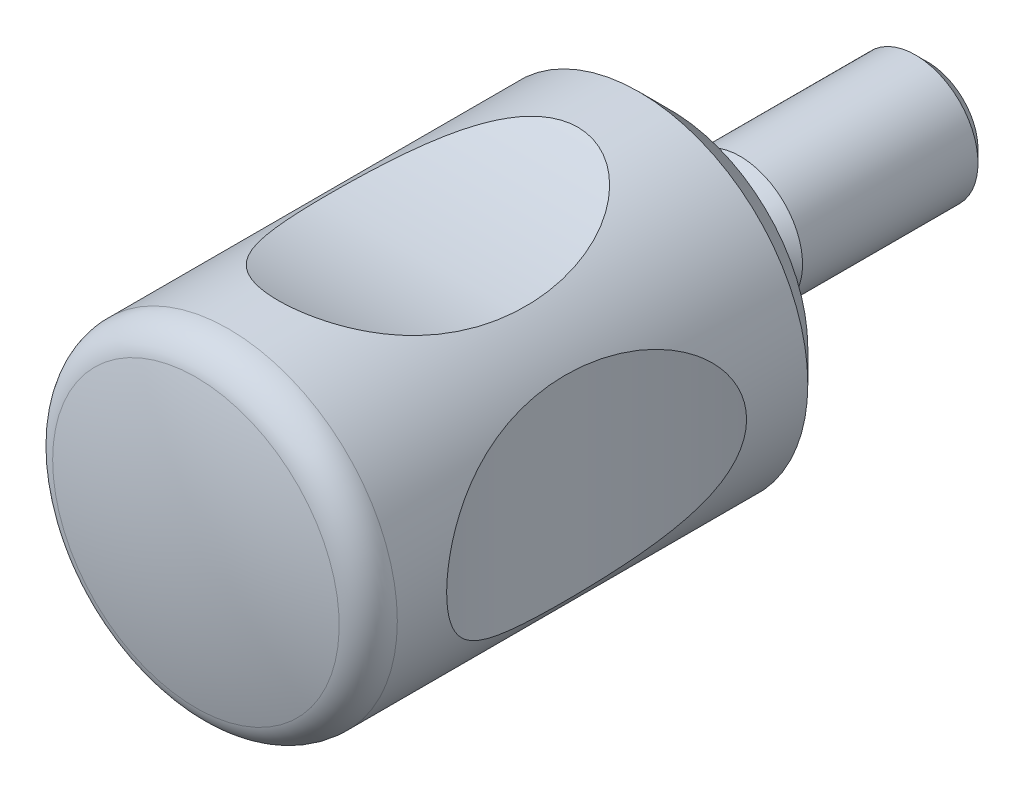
ISO-10303-21;
HEADER;
FILE_DESCRIPTION(('STEP AP214'),'2;1');
FILE_NAME('part.step','',(''),(''),'','','');
FILE_SCHEMA(('AUTOMOTIVE_DESIGN { 1 0 10303 214 1 1 1 1 }'));
ENDSEC;
DATA;
#1=APPLICATION_CONTEXT('core data for automotive mechanical design processes');
#2=APPLICATION_PROTOCOL_DEFINITION('international standard','automotive_design',2000,#1);
#3=PRODUCT_CONTEXT('',#1,'mechanical');
#4=PRODUCT('Part','Part','',(#3));
#5=PRODUCT_RELATED_PRODUCT_CATEGORY('part','',(#4));
#6=PRODUCT_DEFINITION_FORMATION('','',#4);
#7=PRODUCT_DEFINITION_CONTEXT('part definition',#1,'design');
#8=PRODUCT_DEFINITION('design','',#6,#7);
#9=PRODUCT_DEFINITION_SHAPE('','',#8);
#10=(LENGTH_UNIT() NAMED_UNIT(*) SI_UNIT(.MILLI.,.METRE.));
#11=(NAMED_UNIT(*) PLANE_ANGLE_UNIT() SI_UNIT($,.RADIAN.));
#12=(NAMED_UNIT(*) SI_UNIT($,.STERADIAN.) SOLID_ANGLE_UNIT());
#13=UNCERTAINTY_MEASURE_WITH_UNIT(LENGTH_MEASURE(1.E-05),#10,'distance_accuracy_value','');
#14=(GEOMETRIC_REPRESENTATION_CONTEXT(3) GLOBAL_UNCERTAINTY_ASSIGNED_CONTEXT((#13)) GLOBAL_UNIT_ASSIGNED_CONTEXT((#10,
#11,#12)) REPRESENTATION_CONTEXT('',''));
#15=CARTESIAN_POINT('',(0.,0.,0.));
#16=DIRECTION('',(0.,0.,1.));
#17=DIRECTION('',(1.,0.,0.));
#18=AXIS2_PLACEMENT_3D('',#15,#16,#17);
#19=CARTESIAN_POINT('',(0.,0.,20.));
#20=DIRECTION('',(0.,0.,1.));
#21=DIRECTION('',(-1.,0.,0.));
#22=AXIS2_PLACEMENT_3D('',#19,#20,#21);
#23=CYLINDRICAL_SURFACE('',#22,6.75);
#24=CARTESIAN_POINT('',(0.,0.,17.9748015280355));
#25=DIRECTION('',(0.,0.,1.));
#26=DIRECTION('',(-1.,0.,0.));
#27=AXIS2_PLACEMENT_3D('',#24,#25,#26);
#28=CIRCLE('',#27,6.75);
#29=CARTESIAN_POINT('',(-6.75,0.,17.9748015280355));
#30=VERTEX_POINT('',#29);
#31=EDGE_CURVE('E188',#30,#30,#28,.T.);
#32=ORIENTED_EDGE('',*,*,#31,.F.);
#33=EDGE_LOOP('',(#32));
#34=FACE_BOUND('',#33,.T.);
#35=CARTESIAN_POINT('',(6.75,0.,16.));
#36=CARTESIAN_POINT('',(6.74999395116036,-0.15769373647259,15.9999907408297));
#37=CARTESIAN_POINT('',(6.74441090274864,-0.315639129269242,15.987217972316));
#38=CARTESIAN_POINT('',(6.72264211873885,-0.626954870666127,15.9368558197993));
#39=CARTESIAN_POINT('',(6.70643135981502,-0.780313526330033,15.899207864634));
#40=CARTESIAN_POINT('',(6.66513153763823,-1.07745562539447,15.8015023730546));
#41=CARTESIAN_POINT('',(6.64009062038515,-1.22128606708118,15.7415662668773));
#42=CARTESIAN_POINT('',(6.58329088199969,-1.49757061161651,15.6022339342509));
#43=CARTESIAN_POINT('',(6.55153249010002,-1.63002544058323,15.5228389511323));
#44=CARTESIAN_POINT('',(6.46916325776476,-1.93572095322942,15.3105404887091));
#45=CARTESIAN_POINT('',(6.41626243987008,-2.10249528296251,15.1692125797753));
#46=CARTESIAN_POINT('',(6.30727443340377,-2.4098888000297,14.8614397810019));
#47=CARTESIAN_POINT('',(6.25118043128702,-2.5504490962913,14.6949398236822));
#48=CARTESIAN_POINT('',(6.1565016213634,-2.76942976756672,14.394774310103));
#49=CARTESIAN_POINT('',(6.11756575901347,-2.85403782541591,14.2656280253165));
#50=CARTESIAN_POINT('',(6.04153420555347,-3.01164952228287,13.9998662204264));
#51=CARTESIAN_POINT('',(6.00443926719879,-3.08464844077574,13.8632476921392));
#52=CARTESIAN_POINT('',(5.93298990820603,-3.21993597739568,13.5839477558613));
#53=CARTESIAN_POINT('',(5.89863880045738,-3.28221175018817,13.441259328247));
#54=CARTESIAN_POINT('',(5.83340404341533,-3.39679795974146,13.1511520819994));
#55=CARTESIAN_POINT('',(5.80252133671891,-3.44910569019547,13.0037319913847));
#56=CARTESIAN_POINT('',(5.73332795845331,-3.56336087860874,12.6461345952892));
#57=CARTESIAN_POINT('',(5.69690782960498,-3.62094329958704,12.4341887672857));
#58=CARTESIAN_POINT('',(5.6328268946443,-3.71984079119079,12.005217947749));
#59=CARTESIAN_POINT('',(5.60516943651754,-3.761149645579,11.7881910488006));
#60=CARTESIAN_POINT('',(5.55921019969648,-3.82875334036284,11.3506296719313));
#61=CARTESIAN_POINT('',(5.54091764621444,-3.85503337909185,11.1300919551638));
#62=CARTESIAN_POINT('',(5.51408568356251,-3.89331492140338,10.6872343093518));
#63=CARTESIAN_POINT('',(5.50554507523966,-3.90531818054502,10.464914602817));
#64=CARTESIAN_POINT('',(5.49829369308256,-3.91552144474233,10.0154127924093));
#65=CARTESIAN_POINT('',(5.49977997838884,-3.91344473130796,9.78822121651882));
#66=CARTESIAN_POINT('',(5.51302258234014,-3.89476759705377,9.33469840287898));
#67=CARTESIAN_POINT('',(5.524780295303,-3.87816520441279,9.10836728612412));
#68=CARTESIAN_POINT('',(5.558328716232,-3.82992759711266,8.65826204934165));
#69=CARTESIAN_POINT('',(5.58011023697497,-3.79830614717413,8.43448577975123));
#70=CARTESIAN_POINT('',(5.63324925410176,-3.71904504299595,7.99096765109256));
#71=CARTESIAN_POINT('',(5.66460346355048,-3.67141088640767,7.77122443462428));
#72=CARTESIAN_POINT('',(5.72620649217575,-3.57426429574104,7.39776974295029));
#73=CARTESIAN_POINT('',(5.75435840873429,-3.52892240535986,7.2426189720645));
#74=CARTESIAN_POINT('',(5.81482471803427,-3.42837604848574,6.9363900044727));
#75=CARTESIAN_POINT('',(5.84713814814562,-3.37317386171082,6.78531087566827));
#76=CARTESIAN_POINT('',(5.91531321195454,-3.25213654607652,6.48847215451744));
#77=CARTESIAN_POINT('',(5.95117079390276,-3.1863135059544,6.34270674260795));
#78=CARTESIAN_POINT('',(6.02565238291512,-3.04310914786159,6.05776107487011));
#79=CARTESIAN_POINT('',(6.0642754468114,-2.96573176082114,5.91857860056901));
#80=CARTESIAN_POINT('',(6.16018197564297,-2.76264107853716,5.5905958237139));
#81=CARTESIAN_POINT('',(6.21838692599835,-2.63040194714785,5.40600698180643));
#82=CARTESIAN_POINT('',(6.33409854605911,-2.33800915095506,5.06014983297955));
#83=CARTESIAN_POINT('',(6.39160614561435,-2.17789838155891,4.89884637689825));
#84=CARTESIAN_POINT('',(6.48796729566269,-1.86787026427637,4.64024073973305));
#85=CARTESIAN_POINT('',(6.52812575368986,-1.72359931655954,4.53668227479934));
#86=CARTESIAN_POINT('',(6.60107867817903,-1.41869142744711,4.35333686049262));
#87=CARTESIAN_POINT('',(6.63387660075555,-1.2580622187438,4.27353874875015));
#88=CARTESIAN_POINT('',(6.67505134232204,-1.00674681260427,4.17498251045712));
#89=CARTESIAN_POINT('',(6.68748088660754,-0.920790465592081,4.14556080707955));
#90=CARTESIAN_POINT('',(6.70919937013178,-0.746230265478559,4.09448990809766));
#91=CARTESIAN_POINT('',(6.71848994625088,-0.657627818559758,4.07283666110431));
#92=CARTESIAN_POINT('',(6.73361357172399,-0.478554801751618,4.0377306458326));
#93=CARTESIAN_POINT('',(6.73944811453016,-0.388085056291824,4.02427433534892));
#94=CARTESIAN_POINT('',(6.7474667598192,-0.206159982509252,4.00581178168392));
#95=CARTESIAN_POINT('',(6.74965140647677,-0.114704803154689,4.00080427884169));
#96=CARTESIAN_POINT('',(6.7504909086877,0.134119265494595,3.99886614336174));
#97=CARTESIAN_POINT('',(6.74548446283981,0.291660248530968,4.0103177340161));
#98=CARTESIAN_POINT('',(6.72489689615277,0.602110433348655,4.05791225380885));
#99=CARTESIAN_POINT('',(6.70931658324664,0.755019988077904,4.0940532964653));
#100=CARTESIAN_POINT('',(6.66951381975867,1.04966935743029,4.18805972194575));
#101=CARTESIAN_POINT('',(6.64545115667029,1.19156017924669,4.24552440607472));
#102=CARTESIAN_POINT('',(6.59066880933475,1.4645889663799,4.37947768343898));
#103=CARTESIAN_POINT('',(6.55994650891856,1.59572267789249,4.45597375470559));
#104=CARTESIAN_POINT('',(6.47974545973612,1.89992604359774,4.66162716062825));
#105=CARTESIAN_POINT('',(6.42789675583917,2.06664563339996,4.79925934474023));
#106=CARTESIAN_POINT('',(6.3206907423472,2.37447105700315,5.0996243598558));
#107=CARTESIAN_POINT('',(6.26532614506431,2.51552117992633,5.26241040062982));
#108=CARTESIAN_POINT('',(6.17168396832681,2.73543047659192,5.55597670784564));
#109=CARTESIAN_POINT('',(6.13314483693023,2.82041329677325,5.68219289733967));
#110=CARTESIAN_POINT('',(6.05771039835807,2.97898741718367,5.94211229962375));
#111=CARTESIAN_POINT('',(6.02081575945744,3.05257411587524,6.07581850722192));
#112=CARTESIAN_POINT('',(5.94956757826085,3.18921430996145,6.34932870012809));
#113=CARTESIAN_POINT('',(5.91521712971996,3.25225509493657,6.4891397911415));
#114=CARTESIAN_POINT('',(5.84978618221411,3.36852258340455,6.77354108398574));
#115=CARTESIAN_POINT('',(5.81870658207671,3.42174659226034,6.91813258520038));
#116=CARTESIAN_POINT('',(5.74861350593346,3.53868782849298,7.27001209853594));
#117=CARTESIAN_POINT('',(5.71143510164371,3.59801851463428,7.4791315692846));
#118=CARTESIAN_POINT('',(5.64556393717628,3.70051372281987,7.90262266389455));
#119=CARTESIAN_POINT('',(5.61687448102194,3.74367195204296,8.11699629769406));
#120=CARTESIAN_POINT('',(5.5686032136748,3.81510365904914,8.54941591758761));
#121=CARTESIAN_POINT('',(5.54903014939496,3.84336284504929,8.7674652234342));
#122=CARTESIAN_POINT('',(5.51941299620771,3.88577464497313,9.20552994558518));
#123=CARTESIAN_POINT('',(5.50936773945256,3.8999289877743,9.4255451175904));
#124=CARTESIAN_POINT('',(5.49886896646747,3.9147190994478,9.87090691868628));
#125=CARTESIAN_POINT('',(5.49862229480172,3.91506334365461,10.0962680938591));
#126=CARTESIAN_POINT('',(5.50825026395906,3.90150601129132,10.5463776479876));
#127=CARTESIAN_POINT('',(5.51812616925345,3.88760265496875,10.7711259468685));
#128=CARTESIAN_POINT('',(5.54780705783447,3.84512789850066,11.2184066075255));
#129=CARTESIAN_POINT('',(5.56760442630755,3.81656774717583,11.4409405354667));
#130=CARTESIAN_POINT('',(5.61672759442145,3.74390295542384,11.8823674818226));
#131=CARTESIAN_POINT('',(5.6460505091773,3.69980302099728,12.101261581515));
#132=CARTESIAN_POINT('',(5.70499518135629,3.60800280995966,12.4788752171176));
#133=CARTESIAN_POINT('',(5.73266592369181,3.56403360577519,12.6388128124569));
#134=CARTESIAN_POINT('',(5.79250585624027,3.46593193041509,12.9546671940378));
#135=CARTESIAN_POINT('',(5.82467404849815,3.41180171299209,13.1105848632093));
#136=CARTESIAN_POINT('',(5.89289301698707,3.29257164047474,13.4171159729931));
#137=CARTESIAN_POINT('',(5.92893933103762,3.22748434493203,13.5677352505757));
#138=CARTESIAN_POINT('',(6.00412240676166,3.08536268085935,13.8623661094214));
#139=CARTESIAN_POINT('',(6.04325806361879,3.00833257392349,14.006380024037));
#140=CARTESIAN_POINT('',(6.14016791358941,2.80678934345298,14.3438840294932));
#141=CARTESIAN_POINT('',(6.19897568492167,2.67579150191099,14.5333003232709));
#142=CARTESIAN_POINT('',(6.3164241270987,2.38531192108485,14.8889654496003));
#143=CARTESIAN_POINT('',(6.37506491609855,2.22587370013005,15.0552489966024));
#144=CARTESIAN_POINT('',(6.47373031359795,1.91660901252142,15.3224087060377));
#145=CARTESIAN_POINT('',(6.51497990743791,1.77265107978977,15.4295894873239));
#146=CARTESIAN_POINT('',(6.5903228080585,1.46787987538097,15.6201342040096));
#147=CARTESIAN_POINT('',(6.62442062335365,1.30707731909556,15.7035131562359));
#148=CARTESIAN_POINT('',(6.67780163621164,0.995410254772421,15.8317991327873));
#149=CARTESIAN_POINT('',(6.69849542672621,0.846338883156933,15.8804719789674));
#150=CARTESIAN_POINT('',(6.72996740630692,0.54160443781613,15.9539348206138));
#151=CARTESIAN_POINT('',(6.74077171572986,0.385959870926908,15.978787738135));
#152=CARTESIAN_POINT('',(6.74739981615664,0.191235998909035,15.9940267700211));
#153=CARTESIAN_POINT('',(6.74837330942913,0.15303508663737,15.996264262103));
#154=CARTESIAN_POINT('',(6.7496741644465,0.076561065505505,15.9992520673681));
#155=CARTESIAN_POINT('',(6.75000146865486,0.0382879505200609,16.0000022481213));
#156=CARTESIAN_POINT('',(6.75,0.,16.));
#157=B_SPLINE_CURVE_WITH_KNOTS('',3,(#35,#36,#37,#38,#39,#40,#41,#42,#43,#44,#45,#46,#47,#48,
#49,#50,#51,#52,#53,#54,#55,#56,#57,#58,#59,#60,#61,#62,#63,#64,#65,#66,#67,#68,#69,#70,#71,#72,
#73,#74,#75,#76,#77,#78,#79,#80,#81,#82,#83,#84,#85,#86,#87,#88,#89,#90,#91,#92,#93,#94,#95,#96,
#97,#98,#99,#100,#101,#102,#103,#104,#105,#106,#107,#108,#109,#110,#111,#112,#113,#114,#115,
#116,#117,#118,#119,#120,#121,#122,#123,#124,#125,#126,#127,#128,#129,#130,#131,#132,#133,#134,
#135,#136,#137,#138,#139,#140,#141,#142,#143,#144,#145,#146,#147,#148,#149,#150,#151,#152,#153,
#154,#155,#156),.UNSPECIFIED.,.T.,.F.,(4,2,2,2,2,2,2,2,2,2,2,2,2,2,2,2,2,2,2,2,2,2,2,2,2,2,2,2,
2,2,2,2,2,2,2,2,2,2,2,2,2,2,2,2,2,2,2,2,2,2,2,2,2,2,2,2,2,2,2,2,4),(0.,0.472924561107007,
0.946966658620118,1.41846304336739,1.88992930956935,2.56094984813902,3.23346017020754,
3.71053583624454,4.18780499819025,4.66564196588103,5.1436084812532,5.81054388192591,
6.47773379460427,7.14557968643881,7.81334344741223,8.49426851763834,9.1752860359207,
9.85568061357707,10.5358418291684,11.0277105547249,11.5194657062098,12.0106650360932,
12.5016976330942,13.2025519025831,13.9023369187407,14.4465579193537,14.9905228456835,
15.2652650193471,15.5398637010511,15.8143436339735,16.0887826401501,16.5602965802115,
17.0317744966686,17.4948077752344,17.9580232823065,18.6213069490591,19.286013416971,
19.7563100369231,20.2267960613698,20.6978451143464,21.169023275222,21.8296675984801,
22.4905687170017,23.1521026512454,23.8135554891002,24.488964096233,25.1644570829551,
25.8394324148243,26.5142035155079,27.0183254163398,27.5223356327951,28.0257720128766,
28.529029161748,29.2397190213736,29.9493305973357,30.4997415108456,31.0498043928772,
31.5223474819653,31.9936388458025,32.1084544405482,32.2232802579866),.UNSPECIFIED.);
#158=CARTESIAN_POINT('',(6.75,0.,16.));
#159=VERTEX_POINT('',#158);
#160=EDGE_CURVE('E9',#159,#159,#157,.T.);
#161=ORIENTED_EDGE('',*,*,#160,.F.);
#162=EDGE_LOOP('',(#161));
#163=FACE_BOUND('',#162,.T.);
#164=CARTESIAN_POINT('',(0.,6.75,16.));
#165=CARTESIAN_POINT('',(0.15769373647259,6.74999395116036,15.9999907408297));
#166=CARTESIAN_POINT('',(0.315639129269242,6.74441090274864,15.987217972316));
#167=CARTESIAN_POINT('',(0.626954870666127,6.72264211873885,15.9368558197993));
#168=CARTESIAN_POINT('',(0.780313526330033,6.70643135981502,15.899207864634));
#169=CARTESIAN_POINT('',(1.07745562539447,6.66513153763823,15.8015023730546));
#170=CARTESIAN_POINT('',(1.22128606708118,6.64009062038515,15.7415662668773));
#171=CARTESIAN_POINT('',(1.49757061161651,6.58329088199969,15.6022339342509));
#172=CARTESIAN_POINT('',(1.63002544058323,6.55153249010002,15.5228389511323));
#173=CARTESIAN_POINT('',(1.93572095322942,6.46916325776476,15.3105404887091));
#174=CARTESIAN_POINT('',(2.10249528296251,6.41626243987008,15.1692125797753));
#175=CARTESIAN_POINT('',(2.4098888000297,6.30727443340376,14.8614397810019));
#176=CARTESIAN_POINT('',(2.55044909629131,6.25118043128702,14.6949398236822));
#177=CARTESIAN_POINT('',(2.76942976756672,6.1565016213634,14.394774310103));
#178=CARTESIAN_POINT('',(2.85403782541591,6.11756575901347,14.2656280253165));
#179=CARTESIAN_POINT('',(3.01164952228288,6.04153420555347,13.9998662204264));
#180=CARTESIAN_POINT('',(3.08464844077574,6.00443926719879,13.8632476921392));
#181=CARTESIAN_POINT('',(3.21993597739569,5.93298990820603,13.5839477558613));
#182=CARTESIAN_POINT('',(3.28221175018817,5.89863880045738,13.441259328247));
#183=CARTESIAN_POINT('',(3.39679795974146,5.83340404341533,13.1511520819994));
#184=CARTESIAN_POINT('',(3.44910569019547,5.80252133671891,13.0037319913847));
#185=CARTESIAN_POINT('',(3.56336087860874,5.73332795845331,12.6461345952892));
#186=CARTESIAN_POINT('',(3.62094329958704,5.69690782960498,12.4341887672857));
#187=CARTESIAN_POINT('',(3.71984079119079,5.6328268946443,12.005217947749));
#188=CARTESIAN_POINT('',(3.761149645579,5.60516943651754,11.7881910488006));
#189=CARTESIAN_POINT('',(3.82875334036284,5.55921019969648,11.3506296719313));
#190=CARTESIAN_POINT('',(3.85503337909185,5.54091764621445,11.1300919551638));
#191=CARTESIAN_POINT('',(3.89331492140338,5.51408568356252,10.6872343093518));
#192=CARTESIAN_POINT('',(3.90531818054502,5.50554507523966,10.464914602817));
#193=CARTESIAN_POINT('',(3.91552144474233,5.49829369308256,10.0154127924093));
#194=CARTESIAN_POINT('',(3.91344473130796,5.49977997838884,9.78822121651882));
#195=CARTESIAN_POINT('',(3.89476759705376,5.51302258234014,9.33469840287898));
#196=CARTESIAN_POINT('',(3.87816520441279,5.524780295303,9.10836728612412));
#197=CARTESIAN_POINT('',(3.82992759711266,5.558328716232,8.65826204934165));
#198=CARTESIAN_POINT('',(3.79830614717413,5.58011023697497,8.43448577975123));
#199=CARTESIAN_POINT('',(3.71904504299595,5.63324925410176,7.99096765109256));
#200=CARTESIAN_POINT('',(3.67141088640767,5.66460346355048,7.77122443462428));
#201=CARTESIAN_POINT('',(3.57426429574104,5.72620649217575,7.39776974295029));
#202=CARTESIAN_POINT('',(3.52892240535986,5.75435840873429,7.24261897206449));
#203=CARTESIAN_POINT('',(3.42837604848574,5.81482471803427,6.93639000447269));
#204=CARTESIAN_POINT('',(3.37317386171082,5.84713814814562,6.78531087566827));
#205=CARTESIAN_POINT('',(3.25213654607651,5.91531321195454,6.48847215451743));
#206=CARTESIAN_POINT('',(3.18631350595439,5.95117079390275,6.34270674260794));
#207=CARTESIAN_POINT('',(3.04310914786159,6.02565238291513,6.05776107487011));
#208=CARTESIAN_POINT('',(2.96573176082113,6.06427544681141,5.91857860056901));
#209=CARTESIAN_POINT('',(2.76264107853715,6.16018197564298,5.5905958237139));
#210=CARTESIAN_POINT('',(2.63040194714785,6.21838692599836,5.40600698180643));
#211=CARTESIAN_POINT('',(2.33800915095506,6.33409854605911,5.06014983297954));
#212=CARTESIAN_POINT('',(2.17789838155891,6.39160614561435,4.89884637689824));
#213=CARTESIAN_POINT('',(1.86787026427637,6.48796729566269,4.64024073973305));
#214=CARTESIAN_POINT('',(1.72359931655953,6.52812575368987,4.53668227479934));
#215=CARTESIAN_POINT('',(1.41869142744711,6.60107867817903,4.35333686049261));
#216=CARTESIAN_POINT('',(1.2580622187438,6.63387660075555,4.27353874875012));
#217=CARTESIAN_POINT('',(1.00674681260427,6.67505134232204,4.1749825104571));
#218=CARTESIAN_POINT('',(0.920790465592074,6.68748088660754,4.14556080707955));
#219=CARTESIAN_POINT('',(0.746230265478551,6.70919937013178,4.09448990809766));
#220=CARTESIAN_POINT('',(0.657627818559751,6.71848994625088,4.07283666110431));
#221=CARTESIAN_POINT('',(0.478554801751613,6.73361357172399,4.0377306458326));
#222=CARTESIAN_POINT('',(0.388085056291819,6.73944811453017,4.02427433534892));
#223=CARTESIAN_POINT('',(0.206159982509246,6.7474667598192,4.00581178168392));
#224=CARTESIAN_POINT('',(0.114704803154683,6.74965140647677,4.00080427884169));
#225=CARTESIAN_POINT('',(-0.134119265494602,6.7504909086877,3.99886614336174));
#226=CARTESIAN_POINT('',(-0.291660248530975,6.74548446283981,4.0103177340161));
#227=CARTESIAN_POINT('',(-0.602110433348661,6.72489689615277,4.05791225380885));
#228=CARTESIAN_POINT('',(-0.75501998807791,6.70931658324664,4.0940532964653));
#229=CARTESIAN_POINT('',(-1.0496693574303,6.66951381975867,4.18805972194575));
#230=CARTESIAN_POINT('',(-1.19156017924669,6.64545115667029,4.24552440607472));
#231=CARTESIAN_POINT('',(-1.46458896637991,6.59066880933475,4.37947768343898));
#232=CARTESIAN_POINT('',(-1.59572267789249,6.55994650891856,4.45597375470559));
#233=CARTESIAN_POINT('',(-1.89992604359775,6.47974545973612,4.66162716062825));
#234=CARTESIAN_POINT('',(-2.06664563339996,6.42789675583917,4.79925934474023));
#235=CARTESIAN_POINT('',(-2.37447105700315,6.3206907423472,5.09962435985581));
#236=CARTESIAN_POINT('',(-2.51552117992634,6.26532614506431,5.26241040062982));
#237=CARTESIAN_POINT('',(-2.73543047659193,6.17168396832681,5.55597670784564));
#238=CARTESIAN_POINT('',(-2.82041329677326,6.13314483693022,5.68219289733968));
#239=CARTESIAN_POINT('',(-2.97898741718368,6.05771039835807,5.94211229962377));
#240=CARTESIAN_POINT('',(-3.05257411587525,6.02081575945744,6.07581850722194));
#241=CARTESIAN_POINT('',(-3.18921430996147,5.94956757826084,6.34932870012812));
#242=CARTESIAN_POINT('',(-3.25225509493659,5.91521712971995,6.48913979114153));
#243=CARTESIAN_POINT('',(-3.36852258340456,5.8497861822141,6.77354108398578));
#244=CARTESIAN_POINT('',(-3.42174659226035,5.8187065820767,6.91813258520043));
#245=CARTESIAN_POINT('',(-3.53868782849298,5.74861350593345,7.27001209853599));
#246=CARTESIAN_POINT('',(-3.59801851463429,5.7114351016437,7.47913156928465));
#247=CARTESIAN_POINT('',(-3.70051372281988,5.64556393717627,7.9026226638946));
#248=CARTESIAN_POINT('',(-3.74367195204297,5.61687448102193,8.11699629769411));
#249=CARTESIAN_POINT('',(-3.81510365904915,5.5686032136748,8.54941591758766));
#250=CARTESIAN_POINT('',(-3.8433628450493,5.54903014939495,8.76746522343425));
#251=CARTESIAN_POINT('',(-3.88577464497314,5.5194129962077,9.20552994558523));
#252=CARTESIAN_POINT('',(-3.8999289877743,5.50936773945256,9.42554511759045));
#253=CARTESIAN_POINT('',(-3.9147190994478,5.49886896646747,9.87090691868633));
#254=CARTESIAN_POINT('',(-3.91506334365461,5.49862229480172,10.0962680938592));
#255=CARTESIAN_POINT('',(-3.90150601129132,5.50825026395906,10.5463776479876));
#256=CARTESIAN_POINT('',(-3.88760265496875,5.51812616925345,10.7711259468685));
#257=CARTESIAN_POINT('',(-3.84512789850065,5.54780705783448,11.2184066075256));
#258=CARTESIAN_POINT('',(-3.81656774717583,5.56760442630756,11.4409405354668));
#259=CARTESIAN_POINT('',(-3.74390295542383,5.61672759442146,11.8823674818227));
#260=CARTESIAN_POINT('',(-3.69980302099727,5.64605050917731,12.101261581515));
#261=CARTESIAN_POINT('',(-3.60800280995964,5.7049951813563,12.4788752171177));
#262=CARTESIAN_POINT('',(-3.56403360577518,5.73266592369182,12.638812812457));
#263=CARTESIAN_POINT('',(-3.46593193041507,5.79250585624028,12.9546671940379));
#264=CARTESIAN_POINT('',(-3.41180171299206,5.82467404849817,13.1105848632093));
#265=CARTESIAN_POINT('',(-3.29257164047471,5.89289301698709,13.4171159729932));
#266=CARTESIAN_POINT('',(-3.22748434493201,5.92893933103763,13.5677352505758));
#267=CARTESIAN_POINT('',(-3.08536268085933,6.00412240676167,13.8623661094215));
#268=CARTESIAN_POINT('',(-3.00833257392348,6.0432580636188,14.0063800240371));
#269=CARTESIAN_POINT('',(-2.80678934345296,6.14016791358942,14.3438840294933));
#270=CARTESIAN_POINT('',(-2.67579150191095,6.19897568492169,14.533300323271));
#271=CARTESIAN_POINT('',(-2.38531192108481,6.31642412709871,14.8889654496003));
#272=CARTESIAN_POINT('',(-2.22587370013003,6.37506491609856,15.0552489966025));
#273=CARTESIAN_POINT('',(-1.9166090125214,6.47373031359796,15.3224087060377));
#274=CARTESIAN_POINT('',(-1.77265107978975,6.51497990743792,15.429589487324));
#275=CARTESIAN_POINT('',(-1.46787987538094,6.59032280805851,15.6201342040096));
#276=CARTESIAN_POINT('',(-1.30707731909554,6.62442062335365,15.7035131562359));
#277=CARTESIAN_POINT('',(-0.995410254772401,6.67780163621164,15.8317991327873));
#278=CARTESIAN_POINT('',(-0.846338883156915,6.69849542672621,15.8804719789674));
#279=CARTESIAN_POINT('',(-0.541604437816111,6.72996740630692,15.9539348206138));
#280=CARTESIAN_POINT('',(-0.385959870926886,6.74077171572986,15.978787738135));
#281=CARTESIAN_POINT('',(-0.191235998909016,6.74739981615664,15.9940267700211));
#282=CARTESIAN_POINT('',(-0.153035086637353,6.74837330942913,15.996264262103));
#283=CARTESIAN_POINT('',(-0.0765610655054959,6.7496741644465,15.9992520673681));
#284=CARTESIAN_POINT('',(-0.0382879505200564,6.75000146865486,16.0000022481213));
#285=CARTESIAN_POINT('',(0.,6.75,16.));
#286=B_SPLINE_CURVE_WITH_KNOTS('',3,(#164,#165,#166,#167,#168,#169,#170,#171,#172,#173,#174,
#175,#176,#177,#178,#179,#180,#181,#182,#183,#184,#185,#186,#187,#188,#189,#190,#191,#192,#193,
#194,#195,#196,#197,#198,#199,#200,#201,#202,#203,#204,#205,#206,#207,#208,#209,#210,#211,#212,
#213,#214,#215,#216,#217,#218,#219,#220,#221,#222,#223,#224,#225,#226,#227,#228,#229,#230,#231,
#232,#233,#234,#235,#236,#237,#238,#239,#240,#241,#242,#243,#244,#245,#246,#247,#248,#249,#250,
#251,#252,#253,#254,#255,#256,#257,#258,#259,#260,#261,#262,#263,#264,#265,#266,#267,#268,#269,
#270,#271,#272,#273,#274,#275,#276,#277,#278,#279,#280,#281,#282,#283,#284,#285),.UNSPECIFIED.,
.T.,.F.,(4,2,2,2,2,2,2,2,2,2,2,2,2,2,2,2,2,2,2,2,2,2,2,2,2,2,2,2,2,2,2,2,2,2,2,2,2,2,2,2,2,2,2,
2,2,2,2,2,2,2,2,2,2,2,2,2,2,2,2,2,4),(0.,0.472924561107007,0.946966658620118,1.41846304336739,
1.88992930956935,2.56094984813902,3.23346017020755,3.71053583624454,4.18780499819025,
4.66564196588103,5.1436084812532,5.81054388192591,6.47773379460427,7.14557968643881,
7.81334344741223,8.49426851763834,9.1752860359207,9.85568061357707,10.5358418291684,
11.0277105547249,11.5194657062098,12.0106650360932,12.5016976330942,13.2025519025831,
13.9023369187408,14.4465579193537,14.9905228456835,15.2652650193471,15.5398637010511,
15.8143436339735,16.0887826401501,16.5602965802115,17.0317744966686,17.4948077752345,
17.9580232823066,18.6213069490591,19.286013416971,19.7563100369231,20.2267960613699,
20.6978451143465,21.1690232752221,21.8296675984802,22.4905687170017,23.1521026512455,
23.8135554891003,24.4889640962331,25.1644570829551,25.8394324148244,26.514203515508,
27.0183254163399,27.5223356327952,28.0257720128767,28.529029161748,29.2397190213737,
29.9493305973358,30.4997415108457,31.0498043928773,31.5223474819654,31.9936388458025,
32.1084544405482,32.2232802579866),.UNSPECIFIED.);
#287=CARTESIAN_POINT('',(0.,6.75,16.));
#288=VERTEX_POINT('',#287);
#289=EDGE_CURVE('E212',#288,#288,#286,.T.);
#290=ORIENTED_EDGE('',*,*,#289,.F.);
#291=EDGE_LOOP('',(#290));
#292=FACE_BOUND('',#291,.T.);
#293=CARTESIAN_POINT('',(0.,-6.75,4.));
#294=CARTESIAN_POINT('',(0.15769373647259,-6.74999395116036,4.00000925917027));
#295=CARTESIAN_POINT('',(0.315639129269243,-6.74441090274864,4.01278202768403));
#296=CARTESIAN_POINT('',(0.626954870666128,-6.72264211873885,4.06314418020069));
#297=CARTESIAN_POINT('',(0.780313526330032,-6.70643135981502,4.10079213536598));
#298=CARTESIAN_POINT('',(1.07745562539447,-6.66513153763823,4.19849762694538));
#299=CARTESIAN_POINT('',(1.22128606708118,-6.64009062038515,4.25843373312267));
#300=CARTESIAN_POINT('',(1.49757061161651,-6.58329088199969,4.39776606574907));
#301=CARTESIAN_POINT('',(1.63002544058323,-6.55153249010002,4.4771610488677));
#302=CARTESIAN_POINT('',(1.93572095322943,-6.46916325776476,4.68945951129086));
#303=CARTESIAN_POINT('',(2.10249528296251,-6.41626243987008,4.83078742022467));
#304=CARTESIAN_POINT('',(2.4098888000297,-6.30727443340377,5.13856021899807));
#305=CARTESIAN_POINT('',(2.5504490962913,-6.25118043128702,5.30506017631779));
#306=CARTESIAN_POINT('',(2.76942976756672,-6.1565016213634,5.60522568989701));
#307=CARTESIAN_POINT('',(2.85403782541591,-6.11756575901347,5.73437197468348));
#308=CARTESIAN_POINT('',(3.01164952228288,-6.04153420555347,6.00013377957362));
#309=CARTESIAN_POINT('',(3.08464844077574,-6.00443926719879,6.13675230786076));
#310=CARTESIAN_POINT('',(3.21993597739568,-5.93298990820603,6.41605224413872));
#311=CARTESIAN_POINT('',(3.28221175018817,-5.89863880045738,6.558740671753));
#312=CARTESIAN_POINT('',(3.39679795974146,-5.83340404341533,6.84884791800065));
#313=CARTESIAN_POINT('',(3.44910569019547,-5.80252133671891,6.9962680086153));
#314=CARTESIAN_POINT('',(3.56336087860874,-5.73332795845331,7.35386540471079));
#315=CARTESIAN_POINT('',(3.62094329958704,-5.69690782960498,7.56581123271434));
#316=CARTESIAN_POINT('',(3.71984079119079,-5.6328268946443,7.994782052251));
#317=CARTESIAN_POINT('',(3.761149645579,-5.60516943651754,8.2118089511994));
#318=CARTESIAN_POINT('',(3.82875334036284,-5.55921019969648,8.64937032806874));
#319=CARTESIAN_POINT('',(3.85503337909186,-5.54091764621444,8.8699080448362));
#320=CARTESIAN_POINT('',(3.89331492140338,-5.51408568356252,9.31276569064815));
#321=CARTESIAN_POINT('',(3.90531818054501,-5.50554507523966,9.53508539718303));
#322=CARTESIAN_POINT('',(3.91552144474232,-5.49829369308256,9.98458720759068));
#323=CARTESIAN_POINT('',(3.91344473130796,-5.49977997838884,10.2117787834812));
#324=CARTESIAN_POINT('',(3.89476759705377,-5.51302258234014,10.665301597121));
#325=CARTESIAN_POINT('',(3.87816520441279,-5.524780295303,10.8916327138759));
#326=CARTESIAN_POINT('',(3.82992759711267,-5.558328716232,11.3417379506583));
#327=CARTESIAN_POINT('',(3.79830614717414,-5.58011023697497,11.5655142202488));
#328=CARTESIAN_POINT('',(3.71904504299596,-5.63324925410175,12.0090323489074));
#329=CARTESIAN_POINT('',(3.67141088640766,-5.66460346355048,12.2287755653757));
#330=CARTESIAN_POINT('',(3.57426429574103,-5.72620649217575,12.6022302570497));
#331=CARTESIAN_POINT('',(3.52892240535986,-5.75435840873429,12.7573810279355));
#332=CARTESIAN_POINT('',(3.42837604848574,-5.81482471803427,13.0636099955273));
#333=CARTESIAN_POINT('',(3.37317386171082,-5.84713814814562,13.2146891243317));
#334=CARTESIAN_POINT('',(3.25213654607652,-5.91531321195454,13.5115278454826));
#335=CARTESIAN_POINT('',(3.1863135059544,-5.95117079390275,13.6572932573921));
#336=CARTESIAN_POINT('',(3.0431091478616,-6.02565238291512,13.9422389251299));
#337=CARTESIAN_POINT('',(2.96573176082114,-6.0642754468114,14.081421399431));
#338=CARTESIAN_POINT('',(2.76264107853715,-6.16018197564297,14.4094041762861));
#339=CARTESIAN_POINT('',(2.63040194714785,-6.21838692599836,14.5939930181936));
#340=CARTESIAN_POINT('',(2.33800915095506,-6.33409854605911,14.9398501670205));
#341=CARTESIAN_POINT('',(2.17789838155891,-6.39160614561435,15.1011536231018));
#342=CARTESIAN_POINT('',(1.86787026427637,-6.48796729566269,15.359759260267));
#343=CARTESIAN_POINT('',(1.72359931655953,-6.52812575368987,15.4633177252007));
#344=CARTESIAN_POINT('',(1.41869142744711,-6.60107867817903,15.6466631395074));
#345=CARTESIAN_POINT('',(1.25806221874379,-6.63387660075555,15.7264612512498));
#346=CARTESIAN_POINT('',(1.00674681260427,-6.67505134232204,15.8250174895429));
#347=CARTESIAN_POINT('',(0.920790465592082,-6.68748088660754,15.8544391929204));
#348=CARTESIAN_POINT('',(0.746230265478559,-6.70919937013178,15.9055100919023));
#349=CARTESIAN_POINT('',(0.657627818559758,-6.71848994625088,15.9271633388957));
#350=CARTESIAN_POINT('',(0.478554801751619,-6.73361357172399,15.9622693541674));
#351=CARTESIAN_POINT('',(0.388085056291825,-6.73944811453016,15.9757256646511));
#352=CARTESIAN_POINT('',(0.206159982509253,-6.7474667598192,15.9941882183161));
#353=CARTESIAN_POINT('',(0.11470480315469,-6.74965140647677,15.9991957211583));
#354=CARTESIAN_POINT('',(-0.134119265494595,-6.7504909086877,16.0011338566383));
#355=CARTESIAN_POINT('',(-0.291660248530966,-6.74548446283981,15.9896822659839));
#356=CARTESIAN_POINT('',(-0.602110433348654,-6.72489689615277,15.9420877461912));
#357=CARTESIAN_POINT('',(-0.755019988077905,-6.70931658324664,15.9059467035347));
#358=CARTESIAN_POINT('',(-1.04966935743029,-6.66951381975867,15.8119402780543));
#359=CARTESIAN_POINT('',(-1.19156017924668,-6.64545115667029,15.7544755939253));
#360=CARTESIAN_POINT('',(-1.4645889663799,-6.59066880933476,15.620522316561));
#361=CARTESIAN_POINT('',(-1.59572267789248,-6.55994650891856,15.5440262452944));
#362=CARTESIAN_POINT('',(-1.89992604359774,-6.47974545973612,15.3383728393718));
#363=CARTESIAN_POINT('',(-2.06664563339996,-6.42789675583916,15.2007406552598));
#364=CARTESIAN_POINT('',(-2.37447105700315,-6.32069074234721,14.9003756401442));
#365=CARTESIAN_POINT('',(-2.51552117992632,-6.26532614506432,14.7375895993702));
#366=CARTESIAN_POINT('',(-2.73543047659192,-6.17168396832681,14.4440232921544));
#367=CARTESIAN_POINT('',(-2.82041329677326,-6.13314483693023,14.3178071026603));
#368=CARTESIAN_POINT('',(-2.97898741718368,-6.05771039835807,14.0578877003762));
#369=CARTESIAN_POINT('',(-3.05257411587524,-6.02081575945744,13.9241814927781));
#370=CARTESIAN_POINT('',(-3.18921430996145,-5.94956757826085,13.6506712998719));
#371=CARTESIAN_POINT('',(-3.25225509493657,-5.91521712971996,13.5108602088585));
#372=CARTESIAN_POINT('',(-3.36852258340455,-5.84978618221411,13.2264589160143));
#373=CARTESIAN_POINT('',(-3.42174659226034,-5.81870658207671,13.0818674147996));
#374=CARTESIAN_POINT('',(-3.53868782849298,-5.74861350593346,12.7299879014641));
#375=CARTESIAN_POINT('',(-3.59801851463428,-5.71143510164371,12.5208684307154));
#376=CARTESIAN_POINT('',(-3.70051372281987,-5.64556393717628,12.0973773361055));
#377=CARTESIAN_POINT('',(-3.74367195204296,-5.61687448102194,11.8830037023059));
#378=CARTESIAN_POINT('',(-3.81510365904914,-5.5686032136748,11.4505840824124));
#379=CARTESIAN_POINT('',(-3.84336284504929,-5.54903014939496,11.2325347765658));
#380=CARTESIAN_POINT('',(-3.88577464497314,-5.51941299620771,10.7944700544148));
#381=CARTESIAN_POINT('',(-3.8999289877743,-5.50936773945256,10.5744548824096));
#382=CARTESIAN_POINT('',(-3.9147190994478,-5.49886896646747,10.1290930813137));
#383=CARTESIAN_POINT('',(-3.91506334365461,-5.49862229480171,9.90373190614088));
#384=CARTESIAN_POINT('',(-3.90150601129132,-5.50825026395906,9.45362235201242));
#385=CARTESIAN_POINT('',(-3.88760265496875,-5.51812616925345,9.22887405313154));
#386=CARTESIAN_POINT('',(-3.84512789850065,-5.54780705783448,8.78159339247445));
#387=CARTESIAN_POINT('',(-3.81656774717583,-5.56760442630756,8.55905946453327));
#388=CARTESIAN_POINT('',(-3.74390295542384,-5.61672759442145,8.11763251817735));
#389=CARTESIAN_POINT('',(-3.69980302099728,-5.6460505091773,7.89873841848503));
#390=CARTESIAN_POINT('',(-3.60800280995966,-5.70499518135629,7.52112478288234));
#391=CARTESIAN_POINT('',(-3.56403360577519,-5.73266592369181,7.36118718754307));
#392=CARTESIAN_POINT('',(-3.46593193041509,-5.79250585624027,7.04533280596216));
#393=CARTESIAN_POINT('',(-3.41180171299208,-5.82467404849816,6.88941513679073));
#394=CARTESIAN_POINT('',(-3.29257164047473,-5.89289301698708,6.58288402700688));
#395=CARTESIAN_POINT('',(-3.22748434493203,-5.92893933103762,6.43226474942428));
#396=CARTESIAN_POINT('',(-3.08536268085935,-6.00412240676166,6.13763389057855));
#397=CARTESIAN_POINT('',(-3.00833257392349,-6.04325806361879,5.99361997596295));
#398=CARTESIAN_POINT('',(-2.80678934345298,-6.1401679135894,5.65611597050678));
#399=CARTESIAN_POINT('',(-2.67579150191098,-6.19897568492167,5.46669967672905));
#400=CARTESIAN_POINT('',(-2.38531192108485,-6.3164241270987,5.11103455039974));
#401=CARTESIAN_POINT('',(-2.22587370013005,-6.37506491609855,4.94475100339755));
#402=CARTESIAN_POINT('',(-1.91660901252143,-6.47373031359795,4.67759129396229));
#403=CARTESIAN_POINT('',(-1.77265107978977,-6.51497990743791,4.57041051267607));
#404=CARTESIAN_POINT('',(-1.46787987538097,-6.5903228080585,4.37986579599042));
#405=CARTESIAN_POINT('',(-1.30707731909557,-6.62442062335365,4.29648684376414));
#406=CARTESIAN_POINT('',(-0.99541025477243,-6.67780163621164,4.16820086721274));
#407=CARTESIAN_POINT('',(-0.846338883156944,-6.69849542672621,4.11952802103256));
#408=CARTESIAN_POINT('',(-0.54160443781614,-6.72996740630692,4.04606517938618));
#409=CARTESIAN_POINT('',(-0.385959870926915,-6.74077171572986,4.02121226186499));
#410=CARTESIAN_POINT('',(-0.191235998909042,-6.74739981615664,4.00597322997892));
#411=CARTESIAN_POINT('',(-0.153035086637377,-6.74837330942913,4.00373573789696));
#412=CARTESIAN_POINT('',(-0.0765610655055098,-6.7496741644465,4.00074793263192));
#413=CARTESIAN_POINT('',(-0.0382879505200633,-6.75000146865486,3.99999775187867));
#414=CARTESIAN_POINT('',(0.,-6.75,4.));
#415=B_SPLINE_CURVE_WITH_KNOTS('',3,(#293,#294,#295,#296,#297,#298,#299,#300,#301,#302,#303,
#304,#305,#306,#307,#308,#309,#310,#311,#312,#313,#314,#315,#316,#317,#318,#319,#320,#321,#322,
#323,#324,#325,#326,#327,#328,#329,#330,#331,#332,#333,#334,#335,#336,#337,#338,#339,#340,#341,
#342,#343,#344,#345,#346,#347,#348,#349,#350,#351,#352,#353,#354,#355,#356,#357,#358,#359,#360,
#361,#362,#363,#364,#365,#366,#367,#368,#369,#370,#371,#372,#373,#374,#375,#376,#377,#378,#379,
#380,#381,#382,#383,#384,#385,#386,#387,#388,#389,#390,#391,#392,#393,#394,#395,#396,#397,#398,
#399,#400,#401,#402,#403,#404,#405,#406,#407,#408,#409,#410,#411,#412,#413,#414),.UNSPECIFIED.,
.T.,.F.,(4,2,2,2,2,2,2,2,2,2,2,2,2,2,2,2,2,2,2,2,2,2,2,2,2,2,2,2,2,2,2,2,2,2,2,2,2,2,2,2,2,2,2,
2,2,2,2,2,2,2,2,2,2,2,2,2,2,2,2,2,4),(0.,0.472924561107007,0.946966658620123,1.4184630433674,
1.88992930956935,2.56094984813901,3.23346017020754,3.71053583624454,4.18780499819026,
4.66564196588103,5.1436084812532,5.8105438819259,6.47773379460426,7.14557968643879,
7.81334344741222,8.49426851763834,9.1752860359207,9.85568061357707,10.5358418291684,
11.0277105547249,11.5194657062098,12.0106650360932,12.5016976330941,13.2025519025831,
13.9023369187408,14.4465579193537,14.9905228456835,15.2652650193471,15.5398637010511,
15.8143436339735,16.0887826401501,16.5602965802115,17.0317744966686,17.4948077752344,
17.9580232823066,18.6213069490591,19.286013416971,19.7563100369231,20.2267960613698,
20.6978451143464,21.1690232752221,21.8296675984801,22.4905687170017,23.1521026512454,
23.8135554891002,24.488964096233,25.1644570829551,25.8394324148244,26.514203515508,
27.0183254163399,27.5223356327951,28.0257720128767,28.529029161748,29.2397190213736,
29.9493305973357,30.4997415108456,31.0498043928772,31.5223474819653,31.9936388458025,
32.1084544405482,32.2232802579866),.UNSPECIFIED.);
#416=CARTESIAN_POINT('',(0.,-6.75,4.));
#417=VERTEX_POINT('',#416);
#418=EDGE_CURVE('E205',#417,#417,#415,.T.);
#419=ORIENTED_EDGE('',*,*,#418,.F.);
#420=EDGE_LOOP('',(#419));
#421=FACE_BOUND('',#420,.T.);
#422=CARTESIAN_POINT('',(-6.75,0.,4.));
#423=CARTESIAN_POINT('',(-6.74999395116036,-0.15769373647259,4.00000925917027));
#424=CARTESIAN_POINT('',(-6.74441090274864,-0.315639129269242,4.01278202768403));
#425=CARTESIAN_POINT('',(-6.72264211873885,-0.626954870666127,4.06314418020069));
#426=CARTESIAN_POINT('',(-6.70643135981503,-0.78031352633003,4.10079213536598));
#427=CARTESIAN_POINT('',(-6.66513153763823,-1.07745562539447,4.19849762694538));
#428=CARTESIAN_POINT('',(-6.64009062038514,-1.22128606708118,4.25843373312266));
#429=CARTESIAN_POINT('',(-6.58329088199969,-1.49757061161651,4.39776606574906));
#430=CARTESIAN_POINT('',(-6.55153249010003,-1.63002544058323,4.4771610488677));
#431=CARTESIAN_POINT('',(-6.46916325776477,-1.93572095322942,4.68945951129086));
#432=CARTESIAN_POINT('',(-6.41626243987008,-2.10249528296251,4.83078742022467));
#433=CARTESIAN_POINT('',(-6.30727443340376,-2.40988880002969,5.13856021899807));
#434=CARTESIAN_POINT('',(-6.25118043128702,-2.55044909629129,5.30506017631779));
#435=CARTESIAN_POINT('',(-6.1565016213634,-2.76942976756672,5.60522568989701));
#436=CARTESIAN_POINT('',(-6.11756575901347,-2.85403782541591,5.73437197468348));
#437=CARTESIAN_POINT('',(-6.04153420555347,-3.01164952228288,6.00013377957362));
#438=CARTESIAN_POINT('',(-6.00443926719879,-3.08464844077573,6.13675230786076));
#439=CARTESIAN_POINT('',(-5.93298990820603,-3.21993597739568,6.41605224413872));
#440=CARTESIAN_POINT('',(-5.89863880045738,-3.28221175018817,6.558740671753));
#441=CARTESIAN_POINT('',(-5.83340404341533,-3.39679795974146,6.84884791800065));
#442=CARTESIAN_POINT('',(-5.80252133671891,-3.44910569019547,6.9962680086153));
#443=CARTESIAN_POINT('',(-5.73332795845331,-3.56336087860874,7.35386540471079));
#444=CARTESIAN_POINT('',(-5.69690782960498,-3.62094329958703,7.56581123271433));
#445=CARTESIAN_POINT('',(-5.6328268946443,-3.71984079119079,7.994782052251));
#446=CARTESIAN_POINT('',(-5.60516943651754,-3.761149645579,8.2118089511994));
#447=CARTESIAN_POINT('',(-5.55921019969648,-3.82875334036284,8.64937032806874));
#448=CARTESIAN_POINT('',(-5.54091764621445,-3.85503337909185,8.8699080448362));
#449=CARTESIAN_POINT('',(-5.51408568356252,-3.89331492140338,9.31276569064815));
#450=CARTESIAN_POINT('',(-5.50554507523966,-3.90531818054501,9.53508539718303));
#451=CARTESIAN_POINT('',(-5.49829369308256,-3.91552144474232,9.98458720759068));
#452=CARTESIAN_POINT('',(-5.49977997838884,-3.91344473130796,10.2117787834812));
#453=CARTESIAN_POINT('',(-5.51302258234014,-3.89476759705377,10.665301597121));
#454=CARTESIAN_POINT('',(-5.524780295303,-3.87816520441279,10.8916327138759));
#455=CARTESIAN_POINT('',(-5.558328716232,-3.82992759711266,11.3417379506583));
#456=CARTESIAN_POINT('',(-5.58011023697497,-3.79830614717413,11.5655142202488));
#457=CARTESIAN_POINT('',(-5.63324925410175,-3.71904504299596,12.0090323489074));
#458=CARTESIAN_POINT('',(-5.66460346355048,-3.67141088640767,12.2287755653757));
#459=CARTESIAN_POINT('',(-5.72620649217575,-3.57426429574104,12.6022302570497));
#460=CARTESIAN_POINT('',(-5.75435840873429,-3.52892240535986,12.7573810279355));
#461=CARTESIAN_POINT('',(-5.81482471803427,-3.42837604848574,13.0636099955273));
#462=CARTESIAN_POINT('',(-5.84713814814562,-3.37317386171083,13.2146891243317));
#463=CARTESIAN_POINT('',(-5.91531321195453,-3.25213654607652,13.5115278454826));
#464=CARTESIAN_POINT('',(-5.95117079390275,-3.1863135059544,13.657293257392));
#465=CARTESIAN_POINT('',(-6.02565238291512,-3.0431091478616,13.9422389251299));
#466=CARTESIAN_POINT('',(-6.0642754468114,-2.96573176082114,14.081421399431));
#467=CARTESIAN_POINT('',(-6.16018197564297,-2.76264107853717,14.4094041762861));
#468=CARTESIAN_POINT('',(-6.21838692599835,-2.63040194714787,14.5939930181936));
#469=CARTESIAN_POINT('',(-6.3340985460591,-2.33800915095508,14.9398501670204));
#470=CARTESIAN_POINT('',(-6.39160614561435,-2.17789838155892,15.1011536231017));
#471=CARTESIAN_POINT('',(-6.48796729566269,-1.86787026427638,15.3597592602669));
#472=CARTESIAN_POINT('',(-6.52812575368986,-1.72359931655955,15.4633177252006));
#473=CARTESIAN_POINT('',(-6.60107867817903,-1.41869142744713,15.6466631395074));
#474=CARTESIAN_POINT('',(-6.63387660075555,-1.25806221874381,15.7264612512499));
#475=CARTESIAN_POINT('',(-6.67505134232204,-1.00674681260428,15.8250174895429));
#476=CARTESIAN_POINT('',(-6.68748088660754,-0.920790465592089,15.8544391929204));
#477=CARTESIAN_POINT('',(-6.70919937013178,-0.746230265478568,15.9055100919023));
#478=CARTESIAN_POINT('',(-6.71848994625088,-0.657627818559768,15.9271633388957));
#479=CARTESIAN_POINT('',(-6.73361357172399,-0.478554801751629,15.9622693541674));
#480=CARTESIAN_POINT('',(-6.73944811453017,-0.388085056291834,15.9757256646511));
#481=CARTESIAN_POINT('',(-6.7474667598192,-0.20615998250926,15.9941882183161));
#482=CARTESIAN_POINT('',(-6.74965140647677,-0.114704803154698,15.9991957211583));
#483=CARTESIAN_POINT('',(-6.7504909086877,0.134119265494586,16.0011338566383));
#484=CARTESIAN_POINT('',(-6.74548446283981,0.291660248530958,15.9896822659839));
#485=CARTESIAN_POINT('',(-6.72489689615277,0.602110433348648,15.9420877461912));
#486=CARTESIAN_POINT('',(-6.70931658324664,0.755019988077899,15.9059467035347));
#487=CARTESIAN_POINT('',(-6.66951381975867,1.04966935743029,15.8119402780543));
#488=CARTESIAN_POINT('',(-6.64545115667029,1.19156017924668,15.7544755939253));
#489=CARTESIAN_POINT('',(-6.59066880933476,1.46458896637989,15.620522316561));
#490=CARTESIAN_POINT('',(-6.55994650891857,1.59572267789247,15.5440262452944));
#491=CARTESIAN_POINT('',(-6.47974545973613,1.89992604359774,15.3383728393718));
#492=CARTESIAN_POINT('',(-6.42789675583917,2.06664563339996,15.2007406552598));
#493=CARTESIAN_POINT('',(-6.3206907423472,2.37447105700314,14.9003756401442));
#494=CARTESIAN_POINT('',(-6.26532614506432,2.51552117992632,14.7375895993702));
#495=CARTESIAN_POINT('',(-6.17168396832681,2.73543047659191,14.4440232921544));
#496=CARTESIAN_POINT('',(-6.13314483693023,2.82041329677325,14.3178071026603));
#497=CARTESIAN_POINT('',(-6.05771039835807,2.97898741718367,14.0578877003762));
#498=CARTESIAN_POINT('',(-6.02081575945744,3.05257411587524,13.9241814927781));
#499=CARTESIAN_POINT('',(-5.94956757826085,3.18921430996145,13.6506712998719));
#500=CARTESIAN_POINT('',(-5.91521712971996,3.25225509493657,13.5108602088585));
#501=CARTESIAN_POINT('',(-5.84978618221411,3.36852258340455,13.2264589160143));
#502=CARTESIAN_POINT('',(-5.81870658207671,3.42174659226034,13.0818674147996));
#503=CARTESIAN_POINT('',(-5.74861350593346,3.53868782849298,12.7299879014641));
#504=CARTESIAN_POINT('',(-5.71143510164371,3.59801851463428,12.5208684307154));
#505=CARTESIAN_POINT('',(-5.64556393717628,3.70051372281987,12.0973773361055));
#506=CARTESIAN_POINT('',(-5.61687448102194,3.74367195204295,11.8830037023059));
#507=CARTESIAN_POINT('',(-5.56860321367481,3.81510365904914,11.4505840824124));
#508=CARTESIAN_POINT('',(-5.54903014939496,3.84336284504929,11.2325347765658));
#509=CARTESIAN_POINT('',(-5.51941299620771,3.88577464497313,10.7944700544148));
#510=CARTESIAN_POINT('',(-5.50936773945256,3.8999289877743,10.5744548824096));
#511=CARTESIAN_POINT('',(-5.49886896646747,3.91471909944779,10.1290930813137));
#512=CARTESIAN_POINT('',(-5.49862229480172,3.91506334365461,9.90373190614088));
#513=CARTESIAN_POINT('',(-5.50825026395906,3.90150601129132,9.45362235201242));
#514=CARTESIAN_POINT('',(-5.51812616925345,3.88760265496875,9.22887405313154));
#515=CARTESIAN_POINT('',(-5.54780705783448,3.84512789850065,8.78159339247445));
#516=CARTESIAN_POINT('',(-5.56760442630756,3.81656774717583,8.55905946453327));
#517=CARTESIAN_POINT('',(-5.61672759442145,3.74390295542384,8.11763251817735));
#518=CARTESIAN_POINT('',(-5.6460505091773,3.69980302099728,7.89873841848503));
#519=CARTESIAN_POINT('',(-5.70499518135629,3.60800280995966,7.52112478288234));
#520=CARTESIAN_POINT('',(-5.73266592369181,3.56403360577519,7.36118718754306));
#521=CARTESIAN_POINT('',(-5.79250585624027,3.46593193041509,7.04533280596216));
#522=CARTESIAN_POINT('',(-5.82467404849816,3.41180171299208,6.88941513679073));
#523=CARTESIAN_POINT('',(-5.89289301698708,3.29257164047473,6.58288402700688));
#524=CARTESIAN_POINT('',(-5.92893933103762,3.22748434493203,6.43226474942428));
#525=CARTESIAN_POINT('',(-6.00412240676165,3.08536268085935,6.13763389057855));
#526=CARTESIAN_POINT('',(-6.04325806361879,3.00833257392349,5.99361997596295));
#527=CARTESIAN_POINT('',(-6.14016791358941,2.80678934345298,5.65611597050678));
#528=CARTESIAN_POINT('',(-6.19897568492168,2.67579150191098,5.46669967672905));
#529=CARTESIAN_POINT('',(-6.3164241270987,2.38531192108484,5.11103455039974));
#530=CARTESIAN_POINT('',(-6.37506491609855,2.22587370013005,4.94475100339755));
#531=CARTESIAN_POINT('',(-6.47373031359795,1.91660901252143,4.67759129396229));
#532=CARTESIAN_POINT('',(-6.51497990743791,1.77265107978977,4.57041051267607));
#533=CARTESIAN_POINT('',(-6.5903228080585,1.46787987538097,4.37986579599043));
#534=CARTESIAN_POINT('',(-6.62442062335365,1.30707731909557,4.29648684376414));
#535=CARTESIAN_POINT('',(-6.67780163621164,0.99541025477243,4.16820086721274));
#536=CARTESIAN_POINT('',(-6.6984954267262,0.846338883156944,4.11952802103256));
#537=CARTESIAN_POINT('',(-6.72996740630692,0.54160443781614,4.04606517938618));
#538=CARTESIAN_POINT('',(-6.74077171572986,0.385959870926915,4.02121226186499));
#539=CARTESIAN_POINT('',(-6.74739981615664,0.191235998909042,4.00597322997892));
#540=CARTESIAN_POINT('',(-6.74837330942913,0.153035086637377,4.00373573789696));
#541=CARTESIAN_POINT('',(-6.7496741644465,0.0765610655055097,4.00074793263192));
#542=CARTESIAN_POINT('',(-6.75000146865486,0.0382879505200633,3.99999775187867));
#543=CARTESIAN_POINT('',(-6.75,0.,4.));
#544=B_SPLINE_CURVE_WITH_KNOTS('',3,(#422,#423,#424,#425,#426,#427,#428,#429,#430,#431,#432,
#433,#434,#435,#436,#437,#438,#439,#440,#441,#442,#443,#444,#445,#446,#447,#448,#449,#450,#451,
#452,#453,#454,#455,#456,#457,#458,#459,#460,#461,#462,#463,#464,#465,#466,#467,#468,#469,#470,
#471,#472,#473,#474,#475,#476,#477,#478,#479,#480,#481,#482,#483,#484,#485,#486,#487,#488,#489,
#490,#491,#492,#493,#494,#495,#496,#497,#498,#499,#500,#501,#502,#503,#504,#505,#506,#507,#508,
#509,#510,#511,#512,#513,#514,#515,#516,#517,#518,#519,#520,#521,#522,#523,#524,#525,#526,#527,
#528,#529,#530,#531,#532,#533,#534,#535,#536,#537,#538,#539,#540,#541,#542,#543),.UNSPECIFIED.,
.T.,.F.,(4,2,2,2,2,2,2,2,2,2,2,2,2,2,2,2,2,2,2,2,2,2,2,2,2,2,2,2,2,2,2,2,2,2,2,2,2,2,2,2,2,2,2,
2,2,2,2,2,2,2,2,2,2,2,2,2,2,2,2,2,4),(0.,0.472924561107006,0.946966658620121,1.41846304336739,
1.88992930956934,2.56094984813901,3.23346017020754,3.71053583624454,4.18780499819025,
4.66564196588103,5.1436084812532,5.8105438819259,6.47773379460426,7.14557968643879,
7.81334344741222,8.49426851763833,9.1752860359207,9.85568061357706,10.5358418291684,
11.0277105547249,11.5194657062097,12.0106650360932,12.5016976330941,13.202551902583,
13.9023369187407,14.4465579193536,14.9905228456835,15.2652650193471,15.5398637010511,
15.8143436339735,16.0887826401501,16.5602965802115,17.0317744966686,17.4948077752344,
17.9580232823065,18.6213069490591,19.286013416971,19.7563100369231,20.2267960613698,
20.6978451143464,21.169023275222,21.8296675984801,22.4905687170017,23.1521026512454,
23.8135554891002,24.488964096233,25.1644570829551,25.8394324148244,26.514203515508,
27.0183254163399,27.5223356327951,28.0257720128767,28.529029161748,29.2397190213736,
29.9493305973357,30.4997415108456,31.0498043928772,31.5223474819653,31.9936388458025,
32.1084544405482,32.2232802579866),.UNSPECIFIED.);
#545=CARTESIAN_POINT('',(-6.75,0.,4.));
#546=VERTEX_POINT('',#545);
#547=EDGE_CURVE('E27',#546,#546,#544,.T.);
#548=ORIENTED_EDGE('',*,*,#547,.F.);
#549=EDGE_LOOP('',(#548));
#550=FACE_BOUND('',#549,.T.);
#551=CARTESIAN_POINT('',(0.,0.,1.55));
#552=DIRECTION('',(0.,0.,1.));
#553=DIRECTION('',(-1.,0.,0.));
#554=AXIS2_PLACEMENT_3D('',#551,#552,#553);
#555=CIRCLE('',#554,6.75);
#556=CARTESIAN_POINT('',(-6.75,0.,1.55));
#557=VERTEX_POINT('',#556);
#558=EDGE_CURVE('E191',#557,#557,#555,.T.);
#559=ORIENTED_EDGE('',*,*,#558,.T.);
#560=EDGE_LOOP('',(#559));
#561=FACE_BOUND('',#560,.T.);
#562=ADVANCED_FACE('F14',(#34,#163,#292,#421,#550,#561),#23,.T.);
#563=CARTESIAN_POINT('',(0.,0.,-7.5));
#564=DIRECTION('',(0.,0.,1.));
#565=DIRECTION('',(-1.,0.,0.));
#566=AXIS2_PLACEMENT_3D('',#563,#564,#565);
#567=PLANE('',#566);
#568=CARTESIAN_POINT('',(0.,0.,-7.5));
#569=DIRECTION('',(0.,0.,1.));
#570=DIRECTION('',(-1.,0.,0.));
#571=AXIS2_PLACEMENT_3D('',#568,#569,#570);
#572=CIRCLE('',#571,1.25);
#573=CARTESIAN_POINT('',(-0.625,1.08253175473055,-7.5));
#574=VERTEX_POINT('',#573);
#575=CARTESIAN_POINT('',(0.625,1.08253175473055,-7.5));
#576=VERTEX_POINT('',#575);
#577=EDGE_CURVE('E204',#574,#576,#572,.F.);
#578=ORIENTED_EDGE('',*,*,#577,.F.);
#579=DIRECTION('',(-0.866025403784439,-0.5,0.));
#580=VECTOR('',#579,1.);
#581=CARTESIAN_POINT('',(0.,1.44337567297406,-7.5));
#582=LINE('',#581,#580);
#583=CARTESIAN_POINT('',(0.,1.44337567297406,-7.5));
#584=VERTEX_POINT('',#583);
#585=EDGE_CURVE('E130',#584,#574,#582,.T.);
#586=ORIENTED_EDGE('',*,*,#585,.F.);
#587=DIRECTION('',(-0.866025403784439,0.5,0.));
#588=VECTOR('',#587,1.);
#589=CARTESIAN_POINT('',(1.25,0.721687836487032,-7.5));
#590=LINE('',#589,#588);
#591=EDGE_CURVE('E125',#576,#584,#590,.T.);
#592=ORIENTED_EDGE('',*,*,#591,.F.);
#593=EDGE_LOOP('',(#578,#586,#592));
#594=FACE_BOUND('',#593,.T.);
#595=ADVANCED_FACE('F227',(#594),#567,.F.);
#596=CARTESIAN_POINT('',(1.25,0.,-7.5));
#597=VERTEX_POINT('',#596);
#598=EDGE_CURVE('E102',#576,#597,#572,.F.);
#599=ORIENTED_EDGE('',*,*,#598,.F.);
#600=CARTESIAN_POINT('',(1.25,0.721687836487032,-7.5));
#601=VERTEX_POINT('',#600);
#602=EDGE_CURVE('E126',#601,#576,#590,.T.);
#603=ORIENTED_EDGE('',*,*,#602,.F.);
#604=DIRECTION('',(0.,1.,0.));
#605=VECTOR('',#604,1.);
#606=CARTESIAN_POINT('',(1.25,-0.721687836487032,-7.5));
#607=LINE('',#606,#605);
#608=EDGE_CURVE('E122',#597,#601,#607,.T.);
#609=ORIENTED_EDGE('',*,*,#608,.F.);
#610=EDGE_LOOP('',(#599,#603,#609));
#611=FACE_BOUND('',#610,.T.);
#612=ADVANCED_FACE('F230',(#611),#567,.F.);
#613=CARTESIAN_POINT('',(0.625,-1.08253175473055,-7.5));
#614=VERTEX_POINT('',#613);
#615=EDGE_CURVE('E99',#597,#614,#572,.F.);
#616=ORIENTED_EDGE('',*,*,#615,.F.);
#617=CARTESIAN_POINT('',(1.25,-0.721687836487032,-7.5));
#618=VERTEX_POINT('',#617);
#619=EDGE_CURVE('E112',#618,#597,#607,.T.);
#620=ORIENTED_EDGE('',*,*,#619,.F.);
#621=DIRECTION('',(0.866025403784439,0.5,0.));
#622=VECTOR('',#621,1.);
#623=CARTESIAN_POINT('',(0.,-1.44337567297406,-7.5));
#624=LINE('',#623,#622);
#625=EDGE_CURVE('E108',#614,#618,#624,.T.);
#626=ORIENTED_EDGE('',*,*,#625,.F.);
#627=EDGE_LOOP('',(#616,#620,#626));
#628=FACE_BOUND('',#627,.T.);
#629=ADVANCED_FACE('F110',(#628),#567,.F.);
#630=CARTESIAN_POINT('',(-0.625,-1.08253175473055,-7.5));
#631=VERTEX_POINT('',#630);
#632=EDGE_CURVE('E34',#614,#631,#572,.F.);
#633=ORIENTED_EDGE('',*,*,#632,.F.);
#634=CARTESIAN_POINT('',(0.,-1.44337567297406,-7.5));
#635=VERTEX_POINT('',#634);
#636=EDGE_CURVE('E114',#635,#614,#624,.T.);
#637=ORIENTED_EDGE('',*,*,#636,.F.);
#638=DIRECTION('',(0.866025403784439,-0.5,0.));
#639=VECTOR('',#638,1.);
#640=CARTESIAN_POINT('',(-1.25,-0.721687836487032,-7.5));
#641=LINE('',#640,#639);
#642=EDGE_CURVE('E137',#631,#635,#641,.T.);
#643=ORIENTED_EDGE('',*,*,#642,.F.);
#644=EDGE_LOOP('',(#633,#637,#643));
#645=FACE_BOUND('',#644,.T.);
#646=ADVANCED_FACE('F342',(#645),#567,.F.);
#647=CARTESIAN_POINT('',(-1.25,0.,-7.5));
#648=VERTEX_POINT('',#647);
#649=EDGE_CURVE('E106',#648,#574,#572,.F.);
#650=ORIENTED_EDGE('',*,*,#649,.F.);
#651=DIRECTION('',(0.,-1.,0.));
#652=VECTOR('',#651,1.);
#653=CARTESIAN_POINT('',(-1.25,0.721687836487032,-7.5));
#654=LINE('',#653,#652);
#655=CARTESIAN_POINT('',(-1.25,0.721687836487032,-7.5));
#656=VERTEX_POINT('',#655);
#657=EDGE_CURVE('E134',#656,#648,#654,.T.);
#658=ORIENTED_EDGE('',*,*,#657,.F.);
#659=EDGE_CURVE('E129',#574,#656,#582,.T.);
#660=ORIENTED_EDGE('',*,*,#659,.F.);
#661=EDGE_LOOP('',(#650,#658,#660));
#662=FACE_BOUND('',#661,.T.);
#663=ADVANCED_FACE('F351',(#662),#567,.F.);
#664=EDGE_CURVE('E202',#631,#648,#572,.F.);
#665=ORIENTED_EDGE('',*,*,#664,.F.);
#666=CARTESIAN_POINT('',(-1.25,-0.721687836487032,-7.5));
#667=VERTEX_POINT('',#666);
#668=EDGE_CURVE('E138',#667,#631,#641,.T.);
#669=ORIENTED_EDGE('',*,*,#668,.F.);
#670=EDGE_CURVE('E133',#648,#667,#654,.T.);
#671=ORIENTED_EDGE('',*,*,#670,.F.);
#672=EDGE_LOOP('',(#665,#669,#671));
#673=FACE_BOUND('',#672,.T.);
#674=ADVANCED_FACE('F232',(#673),#567,.F.);
#675=CARTESIAN_POINT('',(0.,0.,-10.));
#676=DIRECTION('',(0.,0.,1.));
#677=DIRECTION('',(-1.,0.,0.));
#678=AXIS2_PLACEMENT_3D('',#675,#676,#677);
#679=PLANE('',#678);
#680=CARTESIAN_POINT('',(0.,0.,-10.));
#681=DIRECTION('',(0.,0.,1.));
#682=DIRECTION('',(-1.,0.,0.));
#683=AXIS2_PLACEMENT_3D('',#680,#681,#682);
#684=CIRCLE('',#683,2.0095);
#685=CARTESIAN_POINT('',(-2.0095,0.,-10.));
#686=VERTEX_POINT('',#685);
#687=EDGE_CURVE('E182',#686,#686,#684,.T.);
#688=ORIENTED_EDGE('',*,*,#687,.F.);
#689=EDGE_LOOP('',(#688));
#690=FACE_BOUND('',#689,.T.);
#691=DIRECTION('',(0.866025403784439,0.5,0.));
#692=VECTOR('',#691,1.);
#693=CARTESIAN_POINT('',(0.,-1.44337567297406,-10.));
#694=LINE('',#693,#692);
#695=CARTESIAN_POINT('',(0.,-1.44337567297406,-10.));
#696=VERTEX_POINT('',#695);
#697=CARTESIAN_POINT('',(1.25,-0.721687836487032,-10.));
#698=VERTEX_POINT('',#697);
#699=EDGE_CURVE('E42',#696,#698,#694,.T.);
#700=ORIENTED_EDGE('',*,*,#699,.T.);
#701=DIRECTION('',(0.,1.,0.));
#702=VECTOR('',#701,1.);
#703=CARTESIAN_POINT('',(1.25,-0.721687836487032,-10.));
#704=LINE('',#703,#702);
#705=CARTESIAN_POINT('',(1.25,0.721687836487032,-10.));
#706=VERTEX_POINT('',#705);
#707=EDGE_CURVE('E142',#698,#706,#704,.T.);
#708=ORIENTED_EDGE('',*,*,#707,.T.);
#709=DIRECTION('',(-0.866025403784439,0.5,0.));
#710=VECTOR('',#709,1.);
#711=CARTESIAN_POINT('',(1.25,0.721687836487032,-10.));
#712=LINE('',#711,#710);
#713=CARTESIAN_POINT('',(0.,1.44337567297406,-10.));
#714=VERTEX_POINT('',#713);
#715=EDGE_CURVE('E145',#706,#714,#712,.T.);
#716=ORIENTED_EDGE('',*,*,#715,.T.);
#717=DIRECTION('',(-0.866025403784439,-0.5,0.));
#718=VECTOR('',#717,1.);
#719=CARTESIAN_POINT('',(0.,1.44337567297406,-10.));
#720=LINE('',#719,#718);
#721=CARTESIAN_POINT('',(-1.25,0.721687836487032,-10.));
#722=VERTEX_POINT('',#721);
#723=EDGE_CURVE('E148',#714,#722,#720,.T.);
#724=ORIENTED_EDGE('',*,*,#723,.T.);
#725=DIRECTION('',(0.,-1.,0.));
#726=VECTOR('',#725,1.);
#727=CARTESIAN_POINT('',(-1.25,0.721687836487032,-10.));
#728=LINE('',#727,#726);
#729=CARTESIAN_POINT('',(-1.25,-0.721687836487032,-10.));
#730=VERTEX_POINT('',#729);
#731=EDGE_CURVE('E151',#722,#730,#728,.T.);
#732=ORIENTED_EDGE('',*,*,#731,.T.);
#733=DIRECTION('',(0.866025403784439,-0.5,0.));
#734=VECTOR('',#733,1.);
#735=CARTESIAN_POINT('',(-1.25,-0.721687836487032,-10.));
#736=LINE('',#735,#734);
#737=EDGE_CURVE('E115',#730,#696,#736,.T.);
#738=ORIENTED_EDGE('',*,*,#737,.T.);
#739=EDGE_LOOP('',(#700,#708,#716,#724,#732,#738));
#740=FACE_BOUND('',#739,.T.);
#741=ADVANCED_FACE('F275',(#690,#740),#679,.F.);
#742=CARTESIAN_POINT('',(0.,0.,0.));
#743=DIRECTION('',(0.,0.,1.));
#744=DIRECTION('',(-1.,0.,0.));
#745=AXIS2_PLACEMENT_3D('',#742,#743,#744);
#746=PLANE('',#745);
#747=CARTESIAN_POINT('',(0.,0.,0.));
#748=DIRECTION('',(0.,0.,1.));
#749=DIRECTION('',(-1.,0.,0.));
#750=AXIS2_PLACEMENT_3D('',#747,#748,#749);
#751=CIRCLE('',#750,3.25);
#752=CARTESIAN_POINT('',(-3.25,0.,0.));
#753=VERTEX_POINT('',#752);
#754=EDGE_CURVE('E200',#753,#753,#751,.T.);
#755=ORIENTED_EDGE('',*,*,#754,.F.);
#756=EDGE_LOOP('',(#755));
#757=FACE_BOUND('',#756,.T.);
#758=CARTESIAN_POINT('',(0.,0.,0.));
#759=DIRECTION('',(0.,0.,1.));
#760=DIRECTION('',(-1.,0.,0.));
#761=AXIS2_PLACEMENT_3D('',#758,#759,#760);
#762=CIRCLE('',#761,1.9);
#763=CARTESIAN_POINT('',(-1.9,0.,0.));
#764=VERTEX_POINT('',#763);
#765=EDGE_CURVE('E167',#764,#764,#762,.T.);
#766=ORIENTED_EDGE('',*,*,#765,.T.);
#767=EDGE_LOOP('',(#766));
#768=FACE_BOUND('',#767,.T.);
#769=ADVANCED_FACE('F16',(#757,#768),#746,.F.);
#770=CARTESIAN_POINT('',(0.,0.,20.));
#771=DIRECTION('',(0.,0.,1.));
#772=DIRECTION('',(-1.,0.,0.));
#773=AXIS2_PLACEMENT_3D('',#770,#771,#772);
#774=CYLINDRICAL_SURFACE('',#773,3.25);
#775=CARTESIAN_POINT('',(0.,0.,0.3));
#776=DIRECTION('',(0.,0.,1.));
#777=DIRECTION('',(-1.,0.,0.));
#778=AXIS2_PLACEMENT_3D('',#775,#776,#777);
#779=CIRCLE('',#778,3.25);
#780=CARTESIAN_POINT('',(-3.25,0.,0.3));
#781=VERTEX_POINT('',#780);
#782=EDGE_CURVE('E197',#781,#781,#779,.T.);
#783=ORIENTED_EDGE('',*,*,#782,.F.);
#784=EDGE_LOOP('',(#783));
#785=FACE_BOUND('',#784,.T.);
#786=ORIENTED_EDGE('',*,*,#754,.T.);
#787=EDGE_LOOP('',(#786));
#788=FACE_BOUND('',#787,.T.);
#789=ADVANCED_FACE('F316',(#785,#788),#774,.T.);
#790=CARTESIAN_POINT('',(0.,-3.25,0.3));
#791=DIRECTION('',(0.,0.,1.));
#792=DIRECTION('',(-1.,0.,0.));
#793=AXIS2_PLACEMENT_3D('',#790,#791,#792);
#794=PLANE('',#793);
#795=CARTESIAN_POINT('',(0.,0.,0.3));
#796=DIRECTION('',(0.,0.,1.));
#797=DIRECTION('',(-1.,0.,0.));
#798=AXIS2_PLACEMENT_3D('',#795,#796,#797);
#799=CIRCLE('',#798,5.5);
#800=CARTESIAN_POINT('',(-5.5,0.,0.3));
#801=VERTEX_POINT('',#800);
#802=EDGE_CURVE('E194',#801,#801,#799,.T.);
#803=ORIENTED_EDGE('',*,*,#802,.F.);
#804=EDGE_LOOP('',(#803));
#805=FACE_BOUND('',#804,.T.);
#806=ORIENTED_EDGE('',*,*,#782,.T.);
#807=EDGE_LOOP('',(#806));
#808=FACE_BOUND('',#807,.T.);
#809=ADVANCED_FACE('F290',(#805,#808),#794,.F.);
#810=CARTESIAN_POINT('',(0.,0.,0.3));
#811=DIRECTION('',(0.,0.,1.));
#812=DIRECTION('',(-1.,0.,0.));
#813=AXIS2_PLACEMENT_3D('',#810,#811,#812);
#814=CONICAL_SURFACE('',#813,5.5,0.785398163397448);
#815=ORIENTED_EDGE('',*,*,#558,.F.);
#816=EDGE_LOOP('',(#815));
#817=FACE_BOUND('',#816,.T.);
#818=ORIENTED_EDGE('',*,*,#802,.T.);
#819=EDGE_LOOP('',(#818));
#820=FACE_BOUND('',#819,.T.);
#821=ADVANCED_FACE('F283',(#817,#820),#814,.T.);
#822=CARTESIAN_POINT('',(0.,0.,17.9748015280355));
#823=DIRECTION('',(0.,0.,1.));
#824=DIRECTION('',(-1.,0.,0.));
#825=AXIS2_PLACEMENT_3D('',#822,#823,#824);
#826=TOROIDAL_SURFACE('',#825,5.4,1.35);
#827=ORIENTED_EDGE('',*,*,#31,.T.);
#828=EDGE_LOOP('',(#827));
#829=FACE_BOUND('',#828,.T.);
#830=CARTESIAN_POINT('',(0.,0.,19.2832390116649));
#831=DIRECTION('',(0.,0.,1.));
#832=DIRECTION('',(-1.,0.,0.));
#833=AXIS2_PLACEMENT_3D('',#830,#831,#832);
#834=CIRCLE('',#833,5.7324023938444);
#835=CARTESIAN_POINT('',(-5.7324023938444,0.,19.2832390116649));
#836=VERTEX_POINT('',#835);
#837=EDGE_CURVE('E185',#836,#836,#834,.T.);
#838=ORIENTED_EDGE('',*,*,#837,.F.);
#839=EDGE_LOOP('',(#838));
#840=FACE_BOUND('',#839,.T.);
#841=ADVANCED_FACE('F280',(#829,#840),#826,.T.);
#842=CARTESIAN_POINT('',(0.,0.,-3.28125000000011));
#843=DIRECTION('',(0.,0.,1.));
#844=DIRECTION('',(0.,1.,0.));
#845=AXIS2_PLACEMENT_3D('',#842,#843,#844);
#846=SPHERICAL_SURFACE('',#845,23.28125);
#847=ORIENTED_EDGE('',*,*,#837,.T.);
#848=EDGE_LOOP('',(#847));
#849=FACE_BOUND('',#848,.T.);
#850=ADVANCED_FACE('F273',(#849),#846,.T.);
#851=CARTESIAN_POINT('',(0.,0.,-10.));
#852=DIRECTION('',(0.,0.,1.));
#853=DIRECTION('',(-1.,0.,0.));
#854=AXIS2_PLACEMENT_3D('',#851,#852,#853);
#855=CONICAL_SURFACE('',#854,2.0095,0.785398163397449);
#856=CARTESIAN_POINT('',(0.,0.,-9.5095));
#857=DIRECTION('',(0.,0.,1.));
#858=DIRECTION('',(-1.,0.,0.));
#859=AXIS2_PLACEMENT_3D('',#856,#857,#858);
#860=CIRCLE('',#859,2.5);
#861=CARTESIAN_POINT('',(-2.5,0.,-9.5095));
#862=VERTEX_POINT('',#861);
#863=EDGE_CURVE('E179',#862,#862,#860,.T.);
#864=ORIENTED_EDGE('',*,*,#863,.F.);
#865=EDGE_LOOP('',(#864));
#866=FACE_BOUND('',#865,.T.);
#867=ORIENTED_EDGE('',*,*,#687,.T.);
#868=EDGE_LOOP('',(#867));
#869=FACE_BOUND('',#868,.T.);
#870=ADVANCED_FACE('F269',(#866,#869),#855,.T.);
#871=CARTESIAN_POINT('',(0.,0.,0.));
#872=DIRECTION('',(0.,0.,1.));
#873=DIRECTION('',(-1.,0.,0.));
#874=AXIS2_PLACEMENT_3D('',#871,#872,#873);
#875=CYLINDRICAL_SURFACE('',#874,2.5);
#876=CARTESIAN_POINT('',(0.,0.,-2.4905));
#877=DIRECTION('',(0.,0.,1.));
#878=DIRECTION('',(-1.,0.,0.));
#879=AXIS2_PLACEMENT_3D('',#876,#877,#878);
#880=CIRCLE('',#879,2.5);
#881=CARTESIAN_POINT('',(-2.5,0.,-2.4905));
#882=VERTEX_POINT('',#881);
#883=EDGE_CURVE('E176',#882,#882,#880,.T.);
#884=ORIENTED_EDGE('',*,*,#883,.F.);
#885=EDGE_LOOP('',(#884));
#886=FACE_BOUND('',#885,.T.);
#887=ORIENTED_EDGE('',*,*,#863,.T.);
#888=EDGE_LOOP('',(#887));
#889=FACE_BOUND('',#888,.T.);
#890=ADVANCED_FACE('F265',(#886,#889),#875,.T.);
#891=CARTESIAN_POINT('',(0.,0.,-2.4905));
#892=DIRECTION('',(0.,0.,-1.));
#893=DIRECTION('',(1.,0.,0.));
#894=AXIS2_PLACEMENT_3D('',#891,#892,#893);
#895=CONICAL_SURFACE('',#894,2.5,0.785398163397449);
#896=CARTESIAN_POINT('',(0.,0.,-2.));
#897=DIRECTION('',(0.,0.,1.));
#898=DIRECTION('',(-1.,0.,0.));
#899=AXIS2_PLACEMENT_3D('',#896,#897,#898);
#900=CIRCLE('',#899,2.0095);
#901=CARTESIAN_POINT('',(-2.0095,0.,-2.));
#902=VERTEX_POINT('',#901);
#903=EDGE_CURVE('E173',#902,#902,#900,.T.);
#904=ORIENTED_EDGE('',*,*,#903,.F.);
#905=EDGE_LOOP('',(#904));
#906=FACE_BOUND('',#905,.T.);
#907=ORIENTED_EDGE('',*,*,#883,.T.);
#908=EDGE_LOOP('',(#907));
#909=FACE_BOUND('',#908,.T.);
#910=ADVANCED_FACE('F261',(#906,#909),#895,.T.);
#911=CARTESIAN_POINT('',(0.,-2.0095,-2.));
#912=DIRECTION('',(0.,0.,-1.));
#913=DIRECTION('',(1.,0.,0.));
#914=AXIS2_PLACEMENT_3D('',#911,#912,#913);
#915=PLANE('',#914);
#916=CARTESIAN_POINT('',(0.,0.,-2.));
#917=DIRECTION('',(0.,0.,1.));
#918=DIRECTION('',(-1.,0.,0.));
#919=AXIS2_PLACEMENT_3D('',#916,#917,#918);
#920=CIRCLE('',#919,1.9);
#921=CARTESIAN_POINT('',(-1.9,0.,-2.));
#922=VERTEX_POINT('',#921);
#923=EDGE_CURVE('E170',#922,#922,#920,.T.);
#924=ORIENTED_EDGE('',*,*,#923,.F.);
#925=EDGE_LOOP('',(#924));
#926=FACE_BOUND('',#925,.T.);
#927=ORIENTED_EDGE('',*,*,#903,.T.);
#928=EDGE_LOOP('',(#927));
#929=FACE_BOUND('',#928,.T.);
#930=ADVANCED_FACE('F257',(#926,#929),#915,.F.);
#931=CARTESIAN_POINT('',(0.,0.,0.));
#932=DIRECTION('',(0.,0.,1.));
#933=DIRECTION('',(-1.,0.,0.));
#934=AXIS2_PLACEMENT_3D('',#931,#932,#933);
#935=CYLINDRICAL_SURFACE('',#934,1.9);
#936=ORIENTED_EDGE('',*,*,#765,.F.);
#937=EDGE_LOOP('',(#936));
#938=FACE_BOUND('',#937,.T.);
#939=ORIENTED_EDGE('',*,*,#923,.T.);
#940=EDGE_LOOP('',(#939));
#941=FACE_BOUND('',#940,.T.);
#942=ADVANCED_FACE('F254',(#938,#941),#935,.T.);
#943=CARTESIAN_POINT('',(0.,-1.44337567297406,-7.5));
#944=DIRECTION('',(-0.5,0.866025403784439,0.));
#945=DIRECTION('',(-0.866025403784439,-0.5,0.));
#946=AXIS2_PLACEMENT_3D('',#943,#944,#945);
#947=PLANE('',#946);
#948=ORIENTED_EDGE('',*,*,#699,.F.);
#949=DIRECTION('',(0.,0.,-1.));
#950=VECTOR('',#949,1.);
#951=CARTESIAN_POINT('',(0.,-1.44337567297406,-7.5));
#952=LINE('',#951,#950);
#953=EDGE_CURVE('E119',#635,#696,#952,.T.);
#954=ORIENTED_EDGE('',*,*,#953,.F.);
#955=ORIENTED_EDGE('',*,*,#636,.T.);
#956=ORIENTED_EDGE('',*,*,#625,.T.);
#957=DIRECTION('',(0.,0.,-1.));
#958=VECTOR('',#957,1.);
#959=CARTESIAN_POINT('',(1.25,-0.721687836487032,-7.5));
#960=LINE('',#959,#958);
#961=EDGE_CURVE('E165',#618,#698,#960,.T.);
#962=ORIENTED_EDGE('',*,*,#961,.T.);
#963=EDGE_LOOP('',(#948,#954,#955,#956,#962));
#964=FACE_BOUND('',#963,.T.);
#965=ADVANCED_FACE('F118',(#964),#947,.T.);
#966=CARTESIAN_POINT('',(1.25,-0.721687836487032,-7.5));
#967=DIRECTION('',(-1.,0.,0.));
#968=DIRECTION('',(0.,0.,-1.));
#969=AXIS2_PLACEMENT_3D('',#966,#967,#968);
#970=PLANE('',#969);
#971=ORIENTED_EDGE('',*,*,#707,.F.);
#972=ORIENTED_EDGE('',*,*,#961,.F.);
#973=ORIENTED_EDGE('',*,*,#619,.T.);
#974=ORIENTED_EDGE('',*,*,#608,.T.);
#975=DIRECTION('',(0.,0.,-1.));
#976=VECTOR('',#975,1.);
#977=CARTESIAN_POINT('',(1.25,0.721687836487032,-7.5));
#978=LINE('',#977,#976);
#979=EDGE_CURVE('E163',#601,#706,#978,.T.);
#980=ORIENTED_EDGE('',*,*,#979,.T.);
#981=EDGE_LOOP('',(#971,#972,#973,#974,#980));
#982=FACE_BOUND('',#981,.T.);
#983=ADVANCED_FACE('F247',(#982),#970,.T.);
#984=CARTESIAN_POINT('',(1.25,0.721687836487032,-7.5));
#985=DIRECTION('',(-0.5,-0.866025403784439,0.));
#986=DIRECTION('',(0.866025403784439,-0.5,0.));
#987=AXIS2_PLACEMENT_3D('',#984,#985,#986);
#988=PLANE('',#987);
#989=ORIENTED_EDGE('',*,*,#715,.F.);
#990=ORIENTED_EDGE('',*,*,#979,.F.);
#991=ORIENTED_EDGE('',*,*,#602,.T.);
#992=ORIENTED_EDGE('',*,*,#591,.T.);
#993=DIRECTION('',(0.,0.,-1.));
#994=VECTOR('',#993,1.);
#995=CARTESIAN_POINT('',(0.,1.44337567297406,-7.5));
#996=LINE('',#995,#994);
#997=EDGE_CURVE('E161',#584,#714,#996,.T.);
#998=ORIENTED_EDGE('',*,*,#997,.T.);
#999=EDGE_LOOP('',(#989,#990,#991,#992,#998));
#1000=FACE_BOUND('',#999,.T.);
#1001=ADVANCED_FACE('F243',(#1000),#988,.T.);
#1002=CARTESIAN_POINT('',(0.,1.44337567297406,-7.5));
#1003=DIRECTION('',(0.5,-0.866025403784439,0.));
#1004=DIRECTION('',(0.866025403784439,0.5,0.));
#1005=AXIS2_PLACEMENT_3D('',#1002,#1003,#1004);
#1006=PLANE('',#1005);
#1007=ORIENTED_EDGE('',*,*,#723,.F.);
#1008=ORIENTED_EDGE('',*,*,#997,.F.);
#1009=ORIENTED_EDGE('',*,*,#585,.T.);
#1010=ORIENTED_EDGE('',*,*,#659,.T.);
#1011=DIRECTION('',(0.,0.,-1.));
#1012=VECTOR('',#1011,1.);
#1013=CARTESIAN_POINT('',(-1.25,0.721687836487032,-7.5));
#1014=LINE('',#1013,#1012);
#1015=EDGE_CURVE('E159',#656,#722,#1014,.T.);
#1016=ORIENTED_EDGE('',*,*,#1015,.T.);
#1017=EDGE_LOOP('',(#1007,#1008,#1009,#1010,#1016));
#1018=FACE_BOUND('',#1017,.T.);
#1019=ADVANCED_FACE('F239',(#1018),#1006,.T.);
#1020=CARTESIAN_POINT('',(-1.25,0.721687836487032,-7.5));
#1021=DIRECTION('',(1.,0.,0.));
#1022=DIRECTION('',(0.,0.,1.));
#1023=AXIS2_PLACEMENT_3D('',#1020,#1021,#1022);
#1024=PLANE('',#1023);
#1025=ORIENTED_EDGE('',*,*,#731,.F.);
#1026=ORIENTED_EDGE('',*,*,#1015,.F.);
#1027=ORIENTED_EDGE('',*,*,#657,.T.);
#1028=ORIENTED_EDGE('',*,*,#670,.T.);
#1029=DIRECTION('',(0.,0.,-1.));
#1030=VECTOR('',#1029,1.);
#1031=CARTESIAN_POINT('',(-1.25,-0.721687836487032,-7.5));
#1032=LINE('',#1031,#1030);
#1033=EDGE_CURVE('E157',#667,#730,#1032,.T.);
#1034=ORIENTED_EDGE('',*,*,#1033,.T.);
#1035=EDGE_LOOP('',(#1025,#1026,#1027,#1028,#1034));
#1036=FACE_BOUND('',#1035,.T.);
#1037=ADVANCED_FACE('F235',(#1036),#1024,.T.);
#1038=CARTESIAN_POINT('',(-1.25,-0.721687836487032,-7.5));
#1039=DIRECTION('',(0.5,0.866025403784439,0.));
#1040=DIRECTION('',(-0.866025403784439,0.5,0.));
#1041=AXIS2_PLACEMENT_3D('',#1038,#1039,#1040);
#1042=PLANE('',#1041);
#1043=ORIENTED_EDGE('',*,*,#737,.F.);
#1044=ORIENTED_EDGE('',*,*,#1033,.F.);
#1045=ORIENTED_EDGE('',*,*,#668,.T.);
#1046=ORIENTED_EDGE('',*,*,#642,.T.);
#1047=ORIENTED_EDGE('',*,*,#953,.T.);
#1048=EDGE_LOOP('',(#1043,#1044,#1045,#1046,#1047));
#1049=FACE_BOUND('',#1048,.T.);
#1050=ADVANCED_FACE('F96',(#1049),#1042,.T.);
#1051=CARTESIAN_POINT('',(0.,0.,-7.5));
#1052=DIRECTION('',(0.,0.,-1.));
#1053=DIRECTION('',(1.,0.,0.));
#1054=AXIS2_PLACEMENT_3D('',#1051,#1052,#1053);
#1055=CONICAL_SURFACE('',#1054,1.25,1.0471975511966);
#1056=CARTESIAN_POINT('',(0.,0.,-6.77831216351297));
#1057=VERTEX_POINT('',#1056);
#1058=VERTEX_LOOP('',#1057);
#1059=FACE_BOUND('',#1058,.T.);
#1060=ORIENTED_EDGE('',*,*,#615,.T.);
#1061=ORIENTED_EDGE('',*,*,#632,.T.);
#1062=ORIENTED_EDGE('',*,*,#664,.T.);
#1063=ORIENTED_EDGE('',*,*,#649,.T.);
#1064=ORIENTED_EDGE('',*,*,#577,.T.);
#1065=ORIENTED_EDGE('',*,*,#598,.T.);
#1066=EDGE_LOOP('',(#1060,#1061,#1062,#1063,#1064,#1065));
#1067=FACE_BOUND('',#1066,.T.);
#1068=ADVANCED_FACE('F93',(#1059,#1067),#1055,.F.);
#1069=CARTESIAN_POINT('',(6.75,-20.525,10.));
#1070=DIRECTION('',(-1.,0.,0.));
#1071=DIRECTION('',(0.,0.,-1.));
#1072=AXIS2_PLACEMENT_3D('',#1069,#1070,#1071);
#1073=CYLINDRICAL_SURFACE('',#1072,15.025);
#1074=ORIENTED_EDGE('',*,*,#418,.T.);
#1075=EDGE_LOOP('',(#1074));
#1076=FACE_BOUND('',#1075,.T.);
#1077=ADVANCED_FACE('F95',(#1076),#1073,.F.);
#1078=CARTESIAN_POINT('',(6.75,20.525,10.));
#1079=DIRECTION('',(-1.,0.,0.));
#1080=DIRECTION('',(0.,0.,-1.));
#1081=AXIS2_PLACEMENT_3D('',#1078,#1079,#1080);
#1082=CYLINDRICAL_SURFACE('',#1081,15.025);
#1083=ORIENTED_EDGE('',*,*,#289,.T.);
#1084=EDGE_LOOP('',(#1083));
#1085=FACE_BOUND('',#1084,.T.);
#1086=ADVANCED_FACE('F222',(#1085),#1082,.F.);
#1087=CARTESIAN_POINT('',(-20.525,-6.75,10.));
#1088=DIRECTION('',(0.,1.,0.));
#1089=DIRECTION('',(-1.,0.,0.));
#1090=AXIS2_PLACEMENT_3D('',#1087,#1088,#1089);
#1091=CYLINDRICAL_SURFACE('',#1090,15.025);
#1092=ORIENTED_EDGE('',*,*,#547,.T.);
#1093=EDGE_LOOP('',(#1092));
#1094=FACE_BOUND('',#1093,.T.);
#1095=ADVANCED_FACE('F531',(#1094),#1091,.F.);
#1096=CARTESIAN_POINT('',(20.525,-6.75,10.));
#1097=DIRECTION('',(0.,1.,0.));
#1098=DIRECTION('',(-1.,0.,0.));
#1099=AXIS2_PLACEMENT_3D('',#1096,#1097,#1098);
#1100=CYLINDRICAL_SURFACE('',#1099,15.025);
#1101=ORIENTED_EDGE('',*,*,#160,.T.);
#1102=EDGE_LOOP('',(#1101));
#1103=FACE_BOUND('',#1102,.T.);
#1104=ADVANCED_FACE('F539',(#1103),#1100,.F.);
#1105=CLOSED_SHELL('',(#562,#595,#612,#629,#646,#663,#674,#741,#769,#789,#809,#821,#841,#850,
#870,#890,#910,#930,#942,#965,#983,#1001,#1019,#1037,#1050,#1068,#1077,#1086,#1095,#1104));
#1106=MANIFOLD_SOLID_BREP('B1',#1105);
#1107=ADVANCED_BREP_SHAPE_REPRESENTATION('',(#18,#1106),#14);
#1108=SHAPE_DEFINITION_REPRESENTATION(#9,#1107);
ENDSEC;
END-ISO-10303-21;
